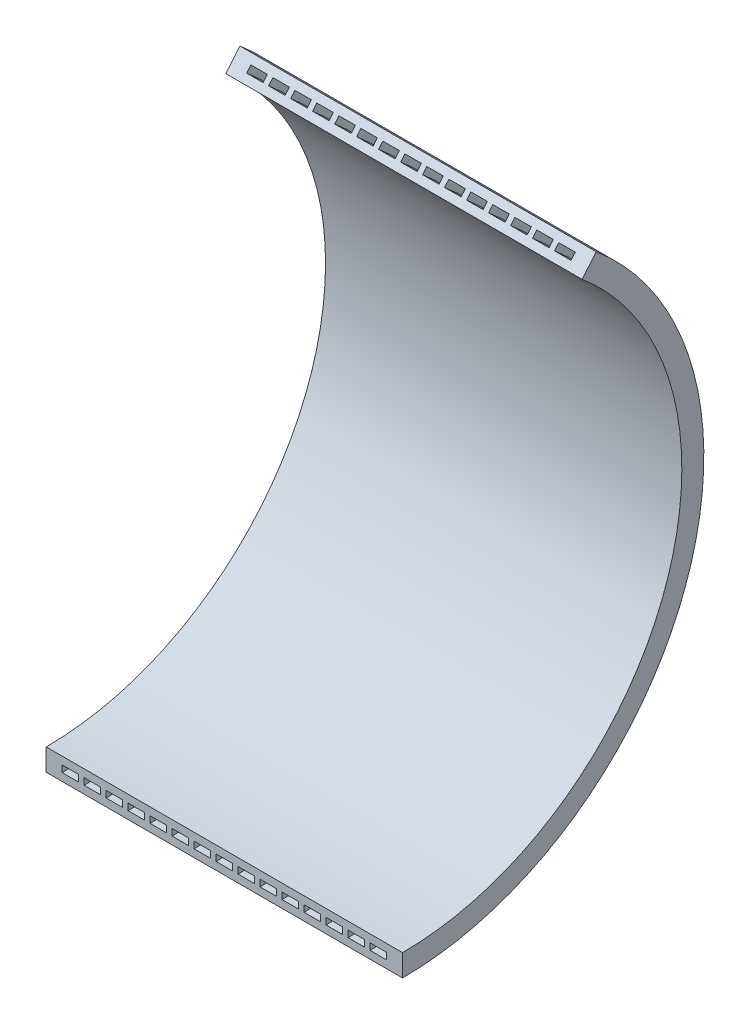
ISO-10303-21;
HEADER;
FILE_DESCRIPTION(('STEP AP214'),'2;1');
FILE_NAME('part.step','',(''),(''),'','','');
FILE_SCHEMA(('AUTOMOTIVE_DESIGN { 1 0 10303 214 1 1 1 1 }'));
ENDSEC;
DATA;
#1=APPLICATION_CONTEXT('core data for automotive mechanical design processes');
#2=APPLICATION_PROTOCOL_DEFINITION('international standard','automotive_design',2000,#1);
#3=PRODUCT_CONTEXT('',#1,'mechanical');
#4=PRODUCT('Part','Part','',(#3));
#5=PRODUCT_RELATED_PRODUCT_CATEGORY('part','',(#4));
#6=PRODUCT_DEFINITION_FORMATION('','',#4);
#7=PRODUCT_DEFINITION_CONTEXT('part definition',#1,'design');
#8=PRODUCT_DEFINITION('design','',#6,#7);
#9=PRODUCT_DEFINITION_SHAPE('','',#8);
#10=(LENGTH_UNIT() NAMED_UNIT(*) SI_UNIT(.MILLI.,.METRE.));
#11=(NAMED_UNIT(*) PLANE_ANGLE_UNIT() SI_UNIT($,.RADIAN.));
#12=(NAMED_UNIT(*) SI_UNIT($,.STERADIAN.) SOLID_ANGLE_UNIT());
#13=UNCERTAINTY_MEASURE_WITH_UNIT(LENGTH_MEASURE(1.E-05),#10,'distance_accuracy_value','');
#14=(GEOMETRIC_REPRESENTATION_CONTEXT(3) GLOBAL_UNCERTAINTY_ASSIGNED_CONTEXT((#13)) GLOBAL_UNIT_ASSIGNED_CONTEXT((#10,
#11,#12)) REPRESENTATION_CONTEXT('',''));
#15=CARTESIAN_POINT('',(0.,0.,0.));
#16=DIRECTION('',(0.,0.,1.));
#17=DIRECTION('',(1.,0.,0.));
#18=AXIS2_PLACEMENT_3D('',#15,#16,#17);
#19=CARTESIAN_POINT('',(-4.74875,87.4425,0.));
#20=DIRECTION('',(-1.,0.,0.));
#21=DIRECTION('',(0.,0.,1.));
#22=AXIS2_PLACEMENT_3D('',#19,#20,#21);
#23=CYLINDRICAL_SURFACE('',#22,85.4775);
#24=CARTESIAN_POINT('',(96.6125,87.4425,0.));
#25=DIRECTION('',(-1.,0.,0.));
#26=DIRECTION('',(0.,0.,1.));
#27=AXIS2_PLACEMENT_3D('',#24,#25,#26);
#28=CIRCLE('',#27,85.4775);
#29=CARTESIAN_POINT('',(96.6125,152.922063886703,-54.9438779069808));
#30=VERTEX_POINT('',#29);
#31=CARTESIAN_POINT('',(96.6125,1.965,0.));
#32=VERTEX_POINT('',#31);
#33=EDGE_CURVE('E11',#30,#32,#28,.T.);
#34=ORIENTED_EDGE('',*,*,#33,.T.);
#35=DIRECTION('',(1.,0.,0.));
#36=VECTOR('',#35,1.);
#37=CARTESIAN_POINT('',(0.,1.965,0.));
#38=LINE('',#37,#36);
#39=CARTESIAN_POINT('',(91.7,1.965,0.));
#40=VERTEX_POINT('',#39);
#41=EDGE_CURVE('E636',#40,#32,#38,.T.);
#42=ORIENTED_EDGE('',*,*,#41,.F.);
#43=CARTESIAN_POINT('',(91.7,87.4425,0.));
#44=DIRECTION('',(-1.,0.,0.));
#45=DIRECTION('',(0.,0.,1.));
#46=AXIS2_PLACEMENT_3D('',#43,#44,#45);
#47=CIRCLE('',#46,85.4775);
#48=CARTESIAN_POINT('',(91.7,152.922063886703,-54.9438779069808));
#49=VERTEX_POINT('',#48);
#50=EDGE_CURVE('E51',#49,#40,#47,.T.);
#51=ORIENTED_EDGE('',*,*,#50,.F.);
#52=DIRECTION('',(1.,0.,0.));
#53=VECTOR('',#52,1.);
#54=CARTESIAN_POINT('',(0.,152.922063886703,-54.9438779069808));
#55=LINE('',#54,#53);
#56=EDGE_CURVE('E825',#49,#30,#55,.T.);
#57=ORIENTED_EDGE('',*,*,#56,.T.);
#58=EDGE_LOOP('',(#34,#42,#51,#57));
#59=FACE_BOUND('',#58,.T.);
#60=ADVANCED_FACE('F36',(#59),#23,.T.);
#61=CARTESIAN_POINT('',(96.6125,154.427341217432,-56.2069555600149));
#62=DIRECTION('',(1.,0.,0.));
#63=DIRECTION('',(0.,0.,-1.));
#64=AXIS2_PLACEMENT_3D('',#61,#62,#63);
#65=PLANE('',#64);
#66=CARTESIAN_POINT('',(96.6125,87.4425,0.));
#67=DIRECTION('',(-1.,0.,0.));
#68=DIRECTION('',(0.,0.,1.));
#69=AXIS2_PLACEMENT_3D('',#66,#67,#68);
#70=CIRCLE('',#69,87.4425);
#71=CARTESIAN_POINT('',(96.6125,154.427341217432,-56.2069555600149));
#72=VERTEX_POINT('',#71);
#73=CARTESIAN_POINT('',(96.6125,0.,0.));
#74=VERTEX_POINT('',#73);
#75=EDGE_CURVE('E44',#72,#74,#70,.T.);
#76=ORIENTED_EDGE('',*,*,#75,.T.);
#77=DIRECTION('',(0.,1.,0.));
#78=VECTOR('',#77,1.);
#79=CARTESIAN_POINT('',(96.6125,0.,0.));
#80=LINE('',#79,#78);
#81=EDGE_CURVE('E639',#74,#32,#80,.T.);
#82=ORIENTED_EDGE('',*,*,#81,.T.);
#83=ORIENTED_EDGE('',*,*,#33,.F.);
#84=DIRECTION('',(0.,-0.766044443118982,0.642787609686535));
#85=VECTOR('',#84,1.);
#86=CARTESIAN_POINT('',(96.6125,154.427341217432,-56.2069555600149));
#87=LINE('',#86,#85);
#88=EDGE_CURVE('E827',#72,#30,#87,.T.);
#89=ORIENTED_EDGE('',*,*,#88,.F.);
#90=EDGE_LOOP('',(#76,#82,#83,#89));
#91=FACE_BOUND('',#90,.T.);
#92=ADVANCED_FACE('F38',(#91),#65,.F.);
#93=CARTESIAN_POINT('',(-4.74875,87.4425,0.));
#94=DIRECTION('',(-1.,0.,0.));
#95=DIRECTION('',(0.,0.,1.));
#96=AXIS2_PLACEMENT_3D('',#93,#94,#95);
#97=CYLINDRICAL_SURFACE('',#96,87.4425);
#98=CARTESIAN_POINT('',(91.7,87.4425,0.));
#99=DIRECTION('',(-1.,0.,0.));
#100=DIRECTION('',(0.,0.,1.));
#101=AXIS2_PLACEMENT_3D('',#98,#99,#100);
#102=CIRCLE('',#101,87.4425);
#103=CARTESIAN_POINT('',(91.7,154.427341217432,-56.2069555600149));
#104=VERTEX_POINT('',#103);
#105=CARTESIAN_POINT('',(91.7,0.,0.));
#106=VERTEX_POINT('',#105);
#107=EDGE_CURVE('E59',#104,#106,#102,.T.);
#108=ORIENTED_EDGE('',*,*,#107,.T.);
#109=DIRECTION('',(1.,0.,0.));
#110=VECTOR('',#109,1.);
#111=CARTESIAN_POINT('',(0.,0.,0.));
#112=LINE('',#111,#110);
#113=EDGE_CURVE('E642',#106,#74,#112,.T.);
#114=ORIENTED_EDGE('',*,*,#113,.T.);
#115=ORIENTED_EDGE('',*,*,#75,.F.);
#116=DIRECTION('',(1.,0.,0.));
#117=VECTOR('',#116,1.);
#118=CARTESIAN_POINT('',(0.,154.427341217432,-56.2069555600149));
#119=LINE('',#118,#117);
#120=EDGE_CURVE('E830',#104,#72,#119,.T.);
#121=ORIENTED_EDGE('',*,*,#120,.F.);
#122=EDGE_LOOP('',(#108,#114,#115,#121));
#123=FACE_BOUND('',#122,.T.);
#124=ADVANCED_FACE('F958',(#123),#97,.F.);
#125=CARTESIAN_POINT('',(-4.74875,87.4425,0.));
#126=DIRECTION('',(-1.,0.,0.));
#127=DIRECTION('',(0.,0.,1.));
#128=AXIS2_PLACEMENT_3D('',#125,#126,#127);
#129=CYLINDRICAL_SURFACE('',#128,87.4425);
#130=CARTESIAN_POINT('',(85.15,87.4425,0.));
#131=DIRECTION('',(-1.,0.,0.));
#132=DIRECTION('',(0.,0.,1.));
#133=AXIS2_PLACEMENT_3D('',#130,#131,#132);
#134=CIRCLE('',#133,87.4425);
#135=CARTESIAN_POINT('',(85.15,154.427341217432,-56.2069555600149));
#136=VERTEX_POINT('',#135);
#137=CARTESIAN_POINT('',(85.15,0.,0.));
#138=VERTEX_POINT('',#137);
#139=EDGE_CURVE('E949',#136,#138,#134,.T.);
#140=ORIENTED_EDGE('',*,*,#139,.T.);
#141=DIRECTION('',(1.,0.,0.));
#142=VECTOR('',#141,1.);
#143=CARTESIAN_POINT('',(0.,0.,0.));
#144=LINE('',#143,#142);
#145=CARTESIAN_POINT('',(90.0625,0.,0.));
#146=VERTEX_POINT('',#145);
#147=EDGE_CURVE('E624',#138,#146,#144,.T.);
#148=ORIENTED_EDGE('',*,*,#147,.T.);
#149=CARTESIAN_POINT('',(90.0625,87.4425,0.));
#150=DIRECTION('',(-1.,0.,0.));
#151=DIRECTION('',(0.,0.,1.));
#152=AXIS2_PLACEMENT_3D('',#149,#150,#151);
#153=CIRCLE('',#152,87.4425);
#154=CARTESIAN_POINT('',(90.0625,154.427341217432,-56.2069555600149));
#155=VERTEX_POINT('',#154);
#156=EDGE_CURVE('E943',#155,#146,#153,.T.);
#157=ORIENTED_EDGE('',*,*,#156,.F.);
#158=DIRECTION('',(1.,0.,0.));
#159=VECTOR('',#158,1.);
#160=CARTESIAN_POINT('',(0.,154.427341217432,-56.2069555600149));
#161=LINE('',#160,#159);
#162=EDGE_CURVE('E813',#136,#155,#161,.T.);
#163=ORIENTED_EDGE('',*,*,#162,.F.);
#164=EDGE_LOOP('',(#140,#148,#157,#163));
#165=FACE_BOUND('',#164,.T.);
#166=ADVANCED_FACE('F975',(#165),#129,.F.);
#167=CARTESIAN_POINT('',(85.15,154.427341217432,-56.2069555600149));
#168=DIRECTION('',(1.,0.,0.));
#169=DIRECTION('',(0.,0.,-1.));
#170=AXIS2_PLACEMENT_3D('',#167,#168,#169);
#171=PLANE('',#170);
#172=CARTESIAN_POINT('',(85.15,87.4425,0.));
#173=DIRECTION('',(-1.,0.,0.));
#174=DIRECTION('',(0.,0.,1.));
#175=AXIS2_PLACEMENT_3D('',#172,#173,#174);
#176=CIRCLE('',#175,85.4775);
#177=CARTESIAN_POINT('',(85.15,152.922063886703,-54.9438779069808));
#178=VERTEX_POINT('',#177);
#179=CARTESIAN_POINT('',(85.15,1.965,0.));
#180=VERTEX_POINT('',#179);
#181=EDGE_CURVE('E947',#178,#180,#176,.T.);
#182=ORIENTED_EDGE('',*,*,#181,.T.);
#183=DIRECTION('',(0.,1.,0.));
#184=VECTOR('',#183,1.);
#185=CARTESIAN_POINT('',(85.15,0.,0.));
#186=LINE('',#185,#184);
#187=EDGE_CURVE('E627',#138,#180,#186,.T.);
#188=ORIENTED_EDGE('',*,*,#187,.F.);
#189=ORIENTED_EDGE('',*,*,#139,.F.);
#190=DIRECTION('',(0.,-0.766044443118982,0.642787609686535));
#191=VECTOR('',#190,1.);
#192=CARTESIAN_POINT('',(85.15,154.427341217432,-56.2069555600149));
#193=LINE('',#192,#191);
#194=EDGE_CURVE('E816',#136,#178,#193,.T.);
#195=ORIENTED_EDGE('',*,*,#194,.T.);
#196=EDGE_LOOP('',(#182,#188,#189,#195));
#197=FACE_BOUND('',#196,.T.);
#198=ADVANCED_FACE('F970',(#197),#171,.T.);
#199=CARTESIAN_POINT('',(-4.74875,87.4425,0.));
#200=DIRECTION('',(-1.,0.,0.));
#201=DIRECTION('',(0.,0.,1.));
#202=AXIS2_PLACEMENT_3D('',#199,#200,#201);
#203=CYLINDRICAL_SURFACE('',#202,85.4775);
#204=CARTESIAN_POINT('',(90.0625,87.4425,0.));
#205=DIRECTION('',(-1.,0.,0.));
#206=DIRECTION('',(0.,0.,1.));
#207=AXIS2_PLACEMENT_3D('',#204,#205,#206);
#208=CIRCLE('',#207,85.4775);
#209=CARTESIAN_POINT('',(90.0625,152.922063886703,-54.9438779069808));
#210=VERTEX_POINT('',#209);
#211=CARTESIAN_POINT('',(90.0625,1.965,0.));
#212=VERTEX_POINT('',#211);
#213=EDGE_CURVE('E945',#210,#212,#208,.T.);
#214=ORIENTED_EDGE('',*,*,#213,.T.);
#215=DIRECTION('',(1.,0.,0.));
#216=VECTOR('',#215,1.);
#217=CARTESIAN_POINT('',(0.,1.965,0.));
#218=LINE('',#217,#216);
#219=EDGE_CURVE('E630',#180,#212,#218,.T.);
#220=ORIENTED_EDGE('',*,*,#219,.F.);
#221=ORIENTED_EDGE('',*,*,#181,.F.);
#222=DIRECTION('',(1.,0.,0.));
#223=VECTOR('',#222,1.);
#224=CARTESIAN_POINT('',(0.,152.922063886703,-54.9438779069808));
#225=LINE('',#224,#223);
#226=EDGE_CURVE('E819',#178,#210,#225,.T.);
#227=ORIENTED_EDGE('',*,*,#226,.T.);
#228=EDGE_LOOP('',(#214,#220,#221,#227));
#229=FACE_BOUND('',#228,.T.);
#230=ADVANCED_FACE('F984',(#229),#203,.T.);
#231=CARTESIAN_POINT('',(-4.74875,87.4425,0.));
#232=DIRECTION('',(-1.,0.,0.));
#233=DIRECTION('',(0.,0.,1.));
#234=AXIS2_PLACEMENT_3D('',#231,#232,#233);
#235=CYLINDRICAL_SURFACE('',#234,87.4425);
#236=CARTESIAN_POINT('',(78.6,87.4425,0.));
#237=DIRECTION('',(-1.,0.,0.));
#238=DIRECTION('',(0.,0.,1.));
#239=AXIS2_PLACEMENT_3D('',#236,#237,#238);
#240=CIRCLE('',#239,87.4425);
#241=CARTESIAN_POINT('',(78.6,154.427341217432,-56.2069555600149));
#242=VERTEX_POINT('',#241);
#243=CARTESIAN_POINT('',(78.6,0.,0.));
#244=VERTEX_POINT('',#243);
#245=EDGE_CURVE('E941',#242,#244,#240,.T.);
#246=ORIENTED_EDGE('',*,*,#245,.T.);
#247=DIRECTION('',(1.,0.,0.));
#248=VECTOR('',#247,1.);
#249=CARTESIAN_POINT('',(0.,0.,0.));
#250=LINE('',#249,#248);
#251=CARTESIAN_POINT('',(83.5125,0.,0.));
#252=VERTEX_POINT('',#251);
#253=EDGE_CURVE('E612',#244,#252,#250,.T.);
#254=ORIENTED_EDGE('',*,*,#253,.T.);
#255=CARTESIAN_POINT('',(83.5125,87.4425,0.));
#256=DIRECTION('',(-1.,0.,0.));
#257=DIRECTION('',(0.,0.,1.));
#258=AXIS2_PLACEMENT_3D('',#255,#256,#257);
#259=CIRCLE('',#258,87.4425);
#260=CARTESIAN_POINT('',(83.5125,154.427341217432,-56.2069555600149));
#261=VERTEX_POINT('',#260);
#262=EDGE_CURVE('E935',#261,#252,#259,.T.);
#263=ORIENTED_EDGE('',*,*,#262,.F.);
#264=DIRECTION('',(1.,0.,0.));
#265=VECTOR('',#264,1.);
#266=CARTESIAN_POINT('',(0.,154.427341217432,-56.2069555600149));
#267=LINE('',#266,#265);
#268=EDGE_CURVE('E801',#242,#261,#267,.T.);
#269=ORIENTED_EDGE('',*,*,#268,.F.);
#270=EDGE_LOOP('',(#246,#254,#263,#269));
#271=FACE_BOUND('',#270,.T.);
#272=ADVANCED_FACE('F996',(#271),#235,.F.);
#273=CARTESIAN_POINT('',(78.6,154.427341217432,-56.2069555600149));
#274=DIRECTION('',(1.,0.,0.));
#275=DIRECTION('',(0.,0.,-1.));
#276=AXIS2_PLACEMENT_3D('',#273,#274,#275);
#277=PLANE('',#276);
#278=CARTESIAN_POINT('',(78.6,87.4425,0.));
#279=DIRECTION('',(-1.,0.,0.));
#280=DIRECTION('',(0.,0.,1.));
#281=AXIS2_PLACEMENT_3D('',#278,#279,#280);
#282=CIRCLE('',#281,85.4775);
#283=CARTESIAN_POINT('',(78.6,152.922063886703,-54.9438779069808));
#284=VERTEX_POINT('',#283);
#285=CARTESIAN_POINT('',(78.6,1.965,0.));
#286=VERTEX_POINT('',#285);
#287=EDGE_CURVE('E939',#284,#286,#282,.T.);
#288=ORIENTED_EDGE('',*,*,#287,.T.);
#289=DIRECTION('',(0.,1.,0.));
#290=VECTOR('',#289,1.);
#291=CARTESIAN_POINT('',(78.6,0.,0.));
#292=LINE('',#291,#290);
#293=EDGE_CURVE('E615',#244,#286,#292,.T.);
#294=ORIENTED_EDGE('',*,*,#293,.F.);
#295=ORIENTED_EDGE('',*,*,#245,.F.);
#296=DIRECTION('',(0.,-0.766044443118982,0.642787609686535));
#297=VECTOR('',#296,1.);
#298=CARTESIAN_POINT('',(78.6,154.427341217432,-56.2069555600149));
#299=LINE('',#298,#297);
#300=EDGE_CURVE('E804',#242,#284,#299,.T.);
#301=ORIENTED_EDGE('',*,*,#300,.T.);
#302=EDGE_LOOP('',(#288,#294,#295,#301));
#303=FACE_BOUND('',#302,.T.);
#304=ADVANCED_FACE('F988',(#303),#277,.T.);
#305=CARTESIAN_POINT('',(-4.74875,87.4425,0.));
#306=DIRECTION('',(-1.,0.,0.));
#307=DIRECTION('',(0.,0.,1.));
#308=AXIS2_PLACEMENT_3D('',#305,#306,#307);
#309=CYLINDRICAL_SURFACE('',#308,85.4775);
#310=CARTESIAN_POINT('',(83.5125,87.4425,0.));
#311=DIRECTION('',(-1.,0.,0.));
#312=DIRECTION('',(0.,0.,1.));
#313=AXIS2_PLACEMENT_3D('',#310,#311,#312);
#314=CIRCLE('',#313,85.4775);
#315=CARTESIAN_POINT('',(83.5125,152.922063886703,-54.9438779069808));
#316=VERTEX_POINT('',#315);
#317=CARTESIAN_POINT('',(83.5125,1.965,0.));
#318=VERTEX_POINT('',#317);
#319=EDGE_CURVE('E937',#316,#318,#314,.T.);
#320=ORIENTED_EDGE('',*,*,#319,.T.);
#321=DIRECTION('',(1.,0.,0.));
#322=VECTOR('',#321,1.);
#323=CARTESIAN_POINT('',(0.,1.965,0.));
#324=LINE('',#323,#322);
#325=EDGE_CURVE('E618',#286,#318,#324,.T.);
#326=ORIENTED_EDGE('',*,*,#325,.F.);
#327=ORIENTED_EDGE('',*,*,#287,.F.);
#328=DIRECTION('',(1.,0.,0.));
#329=VECTOR('',#328,1.);
#330=CARTESIAN_POINT('',(0.,152.922063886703,-54.9438779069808));
#331=LINE('',#330,#329);
#332=EDGE_CURVE('E807',#284,#316,#331,.T.);
#333=ORIENTED_EDGE('',*,*,#332,.T.);
#334=EDGE_LOOP('',(#320,#326,#327,#333));
#335=FACE_BOUND('',#334,.T.);
#336=ADVANCED_FACE('F1214',(#335),#309,.T.);
#337=CARTESIAN_POINT('',(-4.74875,87.4425,0.));
#338=DIRECTION('',(-1.,0.,0.));
#339=DIRECTION('',(0.,0.,1.));
#340=AXIS2_PLACEMENT_3D('',#337,#338,#339);
#341=CYLINDRICAL_SURFACE('',#340,87.4425);
#342=CARTESIAN_POINT('',(72.05,87.4425,0.));
#343=DIRECTION('',(-1.,0.,0.));
#344=DIRECTION('',(0.,0.,1.));
#345=AXIS2_PLACEMENT_3D('',#342,#343,#344);
#346=CIRCLE('',#345,87.4425);
#347=CARTESIAN_POINT('',(72.05,154.427341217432,-56.2069555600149));
#348=VERTEX_POINT('',#347);
#349=CARTESIAN_POINT('',(72.05,0.,0.));
#350=VERTEX_POINT('',#349);
#351=EDGE_CURVE('E933',#348,#350,#346,.T.);
#352=ORIENTED_EDGE('',*,*,#351,.T.);
#353=DIRECTION('',(1.,0.,0.));
#354=VECTOR('',#353,1.);
#355=CARTESIAN_POINT('',(0.,0.,0.));
#356=LINE('',#355,#354);
#357=CARTESIAN_POINT('',(76.9625,0.,0.));
#358=VERTEX_POINT('',#357);
#359=EDGE_CURVE('E600',#350,#358,#356,.T.);
#360=ORIENTED_EDGE('',*,*,#359,.T.);
#361=CARTESIAN_POINT('',(76.9625,87.4425,0.));
#362=DIRECTION('',(-1.,0.,0.));
#363=DIRECTION('',(0.,0.,1.));
#364=AXIS2_PLACEMENT_3D('',#361,#362,#363);
#365=CIRCLE('',#364,87.4425);
#366=CARTESIAN_POINT('',(76.9625,154.427341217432,-56.2069555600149));
#367=VERTEX_POINT('',#366);
#368=EDGE_CURVE('E927',#367,#358,#365,.T.);
#369=ORIENTED_EDGE('',*,*,#368,.F.);
#370=DIRECTION('',(1.,0.,0.));
#371=VECTOR('',#370,1.);
#372=CARTESIAN_POINT('',(0.,154.427341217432,-56.2069555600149));
#373=LINE('',#372,#371);
#374=EDGE_CURVE('E789',#348,#367,#373,.T.);
#375=ORIENTED_EDGE('',*,*,#374,.F.);
#376=EDGE_LOOP('',(#352,#360,#369,#375));
#377=FACE_BOUND('',#376,.T.);
#378=ADVANCED_FACE('F1210',(#377),#341,.F.);
#379=CARTESIAN_POINT('',(72.05,154.427341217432,-56.2069555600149));
#380=DIRECTION('',(1.,0.,0.));
#381=DIRECTION('',(0.,0.,-1.));
#382=AXIS2_PLACEMENT_3D('',#379,#380,#381);
#383=PLANE('',#382);
#384=CARTESIAN_POINT('',(72.05,87.4425,0.));
#385=DIRECTION('',(-1.,0.,0.));
#386=DIRECTION('',(0.,0.,1.));
#387=AXIS2_PLACEMENT_3D('',#384,#385,#386);
#388=CIRCLE('',#387,85.4775);
#389=CARTESIAN_POINT('',(72.05,152.922063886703,-54.9438779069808));
#390=VERTEX_POINT('',#389);
#391=CARTESIAN_POINT('',(72.05,1.965,0.));
#392=VERTEX_POINT('',#391);
#393=EDGE_CURVE('E931',#390,#392,#388,.T.);
#394=ORIENTED_EDGE('',*,*,#393,.T.);
#395=DIRECTION('',(0.,1.,0.));
#396=VECTOR('',#395,1.);
#397=CARTESIAN_POINT('',(72.05,0.,0.));
#398=LINE('',#397,#396);
#399=EDGE_CURVE('E603',#350,#392,#398,.T.);
#400=ORIENTED_EDGE('',*,*,#399,.F.);
#401=ORIENTED_EDGE('',*,*,#351,.F.);
#402=DIRECTION('',(0.,-0.766044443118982,0.642787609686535));
#403=VECTOR('',#402,1.);
#404=CARTESIAN_POINT('',(72.05,154.427341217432,-56.2069555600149));
#405=LINE('',#404,#403);
#406=EDGE_CURVE('E792',#348,#390,#405,.T.);
#407=ORIENTED_EDGE('',*,*,#406,.T.);
#408=EDGE_LOOP('',(#394,#400,#401,#407));
#409=FACE_BOUND('',#408,.T.);
#410=ADVANCED_FACE('F1213',(#409),#383,.T.);
#411=CARTESIAN_POINT('',(-4.74875,87.4425,0.));
#412=DIRECTION('',(-1.,0.,0.));
#413=DIRECTION('',(0.,0.,1.));
#414=AXIS2_PLACEMENT_3D('',#411,#412,#413);
#415=CYLINDRICAL_SURFACE('',#414,85.4775);
#416=CARTESIAN_POINT('',(76.9625,87.4425,0.));
#417=DIRECTION('',(-1.,0.,0.));
#418=DIRECTION('',(0.,0.,1.));
#419=AXIS2_PLACEMENT_3D('',#416,#417,#418);
#420=CIRCLE('',#419,85.4775);
#421=CARTESIAN_POINT('',(76.9625,152.922063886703,-54.9438779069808));
#422=VERTEX_POINT('',#421);
#423=CARTESIAN_POINT('',(76.9625,1.965,0.));
#424=VERTEX_POINT('',#423);
#425=EDGE_CURVE('E929',#422,#424,#420,.T.);
#426=ORIENTED_EDGE('',*,*,#425,.T.);
#427=DIRECTION('',(1.,0.,0.));
#428=VECTOR('',#427,1.);
#429=CARTESIAN_POINT('',(0.,1.965,0.));
#430=LINE('',#429,#428);
#431=EDGE_CURVE('E606',#392,#424,#430,.T.);
#432=ORIENTED_EDGE('',*,*,#431,.F.);
#433=ORIENTED_EDGE('',*,*,#393,.F.);
#434=DIRECTION('',(1.,0.,0.));
#435=VECTOR('',#434,1.);
#436=CARTESIAN_POINT('',(0.,152.922063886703,-54.9438779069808));
#437=LINE('',#436,#435);
#438=EDGE_CURVE('E795',#390,#422,#437,.T.);
#439=ORIENTED_EDGE('',*,*,#438,.T.);
#440=EDGE_LOOP('',(#426,#432,#433,#439));
#441=FACE_BOUND('',#440,.T.);
#442=ADVANCED_FACE('F1198',(#441),#415,.T.);
#443=CARTESIAN_POINT('',(-4.74875,87.4425,0.));
#444=DIRECTION('',(-1.,0.,0.));
#445=DIRECTION('',(0.,0.,1.));
#446=AXIS2_PLACEMENT_3D('',#443,#444,#445);
#447=CYLINDRICAL_SURFACE('',#446,87.4425);
#448=CARTESIAN_POINT('',(65.5,87.4425,0.));
#449=DIRECTION('',(-1.,0.,0.));
#450=DIRECTION('',(0.,0.,1.));
#451=AXIS2_PLACEMENT_3D('',#448,#449,#450);
#452=CIRCLE('',#451,87.4425);
#453=CARTESIAN_POINT('',(65.5,154.427341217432,-56.2069555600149));
#454=VERTEX_POINT('',#453);
#455=CARTESIAN_POINT('',(65.5,0.,0.));
#456=VERTEX_POINT('',#455);
#457=EDGE_CURVE('E925',#454,#456,#452,.T.);
#458=ORIENTED_EDGE('',*,*,#457,.T.);
#459=DIRECTION('',(1.,0.,0.));
#460=VECTOR('',#459,1.);
#461=CARTESIAN_POINT('',(0.,0.,0.));
#462=LINE('',#461,#460);
#463=CARTESIAN_POINT('',(70.4125,0.,0.));
#464=VERTEX_POINT('',#463);
#465=EDGE_CURVE('E588',#456,#464,#462,.T.);
#466=ORIENTED_EDGE('',*,*,#465,.T.);
#467=CARTESIAN_POINT('',(70.4125,87.4425,0.));
#468=DIRECTION('',(-1.,0.,0.));
#469=DIRECTION('',(0.,0.,1.));
#470=AXIS2_PLACEMENT_3D('',#467,#468,#469);
#471=CIRCLE('',#470,87.4425);
#472=CARTESIAN_POINT('',(70.4125,154.427341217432,-56.2069555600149));
#473=VERTEX_POINT('',#472);
#474=EDGE_CURVE('E919',#473,#464,#471,.T.);
#475=ORIENTED_EDGE('',*,*,#474,.F.);
#476=DIRECTION('',(1.,0.,0.));
#477=VECTOR('',#476,1.);
#478=CARTESIAN_POINT('',(0.,154.427341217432,-56.2069555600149));
#479=LINE('',#478,#477);
#480=EDGE_CURVE('E777',#454,#473,#479,.T.);
#481=ORIENTED_EDGE('',*,*,#480,.F.);
#482=EDGE_LOOP('',(#458,#466,#475,#481));
#483=FACE_BOUND('',#482,.T.);
#484=ADVANCED_FACE('F1194',(#483),#447,.F.);
#485=CARTESIAN_POINT('',(65.5,154.427341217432,-56.2069555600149));
#486=DIRECTION('',(1.,0.,0.));
#487=DIRECTION('',(0.,0.,-1.));
#488=AXIS2_PLACEMENT_3D('',#485,#486,#487);
#489=PLANE('',#488);
#490=CARTESIAN_POINT('',(65.5,87.4425,0.));
#491=DIRECTION('',(-1.,0.,0.));
#492=DIRECTION('',(0.,0.,1.));
#493=AXIS2_PLACEMENT_3D('',#490,#491,#492);
#494=CIRCLE('',#493,85.4775);
#495=CARTESIAN_POINT('',(65.5,152.922063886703,-54.9438779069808));
#496=VERTEX_POINT('',#495);
#497=CARTESIAN_POINT('',(65.5,1.965,0.));
#498=VERTEX_POINT('',#497);
#499=EDGE_CURVE('E923',#496,#498,#494,.T.);
#500=ORIENTED_EDGE('',*,*,#499,.T.);
#501=DIRECTION('',(0.,1.,0.));
#502=VECTOR('',#501,1.);
#503=CARTESIAN_POINT('',(65.5,0.,0.));
#504=LINE('',#503,#502);
#505=EDGE_CURVE('E591',#456,#498,#504,.T.);
#506=ORIENTED_EDGE('',*,*,#505,.F.);
#507=ORIENTED_EDGE('',*,*,#457,.F.);
#508=DIRECTION('',(0.,-0.766044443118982,0.642787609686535));
#509=VECTOR('',#508,1.);
#510=CARTESIAN_POINT('',(65.5,154.427341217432,-56.2069555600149));
#511=LINE('',#510,#509);
#512=EDGE_CURVE('E780',#454,#496,#511,.T.);
#513=ORIENTED_EDGE('',*,*,#512,.T.);
#514=EDGE_LOOP('',(#500,#506,#507,#513));
#515=FACE_BOUND('',#514,.T.);
#516=ADVANCED_FACE('F1197',(#515),#489,.T.);
#517=CARTESIAN_POINT('',(-4.74875,87.4425,0.));
#518=DIRECTION('',(-1.,0.,0.));
#519=DIRECTION('',(0.,0.,1.));
#520=AXIS2_PLACEMENT_3D('',#517,#518,#519);
#521=CYLINDRICAL_SURFACE('',#520,85.4775);
#522=CARTESIAN_POINT('',(70.4125,87.4425,0.));
#523=DIRECTION('',(-1.,0.,0.));
#524=DIRECTION('',(0.,0.,1.));
#525=AXIS2_PLACEMENT_3D('',#522,#523,#524);
#526=CIRCLE('',#525,85.4775);
#527=CARTESIAN_POINT('',(70.4125,152.922063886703,-54.9438779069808));
#528=VERTEX_POINT('',#527);
#529=CARTESIAN_POINT('',(70.4125,1.965,0.));
#530=VERTEX_POINT('',#529);
#531=EDGE_CURVE('E921',#528,#530,#526,.T.);
#532=ORIENTED_EDGE('',*,*,#531,.T.);
#533=DIRECTION('',(1.,0.,0.));
#534=VECTOR('',#533,1.);
#535=CARTESIAN_POINT('',(0.,1.965,0.));
#536=LINE('',#535,#534);
#537=EDGE_CURVE('E594',#498,#530,#536,.T.);
#538=ORIENTED_EDGE('',*,*,#537,.F.);
#539=ORIENTED_EDGE('',*,*,#499,.F.);
#540=DIRECTION('',(1.,0.,0.));
#541=VECTOR('',#540,1.);
#542=CARTESIAN_POINT('',(0.,152.922063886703,-54.9438779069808));
#543=LINE('',#542,#541);
#544=EDGE_CURVE('E783',#496,#528,#543,.T.);
#545=ORIENTED_EDGE('',*,*,#544,.T.);
#546=EDGE_LOOP('',(#532,#538,#539,#545));
#547=FACE_BOUND('',#546,.T.);
#548=ADVANCED_FACE('F1182',(#547),#521,.T.);
#549=CARTESIAN_POINT('',(-4.74875,87.4425,0.));
#550=DIRECTION('',(-1.,0.,0.));
#551=DIRECTION('',(0.,0.,1.));
#552=AXIS2_PLACEMENT_3D('',#549,#550,#551);
#553=CYLINDRICAL_SURFACE('',#552,87.4425);
#554=CARTESIAN_POINT('',(58.95,87.4425,0.));
#555=DIRECTION('',(-1.,0.,0.));
#556=DIRECTION('',(0.,0.,1.));
#557=AXIS2_PLACEMENT_3D('',#554,#555,#556);
#558=CIRCLE('',#557,87.4425);
#559=CARTESIAN_POINT('',(58.95,154.427341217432,-56.2069555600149));
#560=VERTEX_POINT('',#559);
#561=CARTESIAN_POINT('',(58.95,0.,0.));
#562=VERTEX_POINT('',#561);
#563=EDGE_CURVE('E917',#560,#562,#558,.T.);
#564=ORIENTED_EDGE('',*,*,#563,.T.);
#565=DIRECTION('',(1.,0.,0.));
#566=VECTOR('',#565,1.);
#567=CARTESIAN_POINT('',(0.,0.,0.));
#568=LINE('',#567,#566);
#569=CARTESIAN_POINT('',(63.8625,0.,0.));
#570=VERTEX_POINT('',#569);
#571=EDGE_CURVE('E576',#562,#570,#568,.T.);
#572=ORIENTED_EDGE('',*,*,#571,.T.);
#573=CARTESIAN_POINT('',(63.8625,87.4425,0.));
#574=DIRECTION('',(-1.,0.,0.));
#575=DIRECTION('',(0.,0.,1.));
#576=AXIS2_PLACEMENT_3D('',#573,#574,#575);
#577=CIRCLE('',#576,87.4425);
#578=CARTESIAN_POINT('',(63.8625,154.427341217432,-56.2069555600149));
#579=VERTEX_POINT('',#578);
#580=EDGE_CURVE('E911',#579,#570,#577,.T.);
#581=ORIENTED_EDGE('',*,*,#580,.F.);
#582=DIRECTION('',(1.,0.,0.));
#583=VECTOR('',#582,1.);
#584=CARTESIAN_POINT('',(0.,154.427341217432,-56.2069555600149));
#585=LINE('',#584,#583);
#586=EDGE_CURVE('E765',#560,#579,#585,.T.);
#587=ORIENTED_EDGE('',*,*,#586,.F.);
#588=EDGE_LOOP('',(#564,#572,#581,#587));
#589=FACE_BOUND('',#588,.T.);
#590=ADVANCED_FACE('F1178',(#589),#553,.F.);
#591=CARTESIAN_POINT('',(58.95,154.427341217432,-56.2069555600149));
#592=DIRECTION('',(1.,0.,0.));
#593=DIRECTION('',(0.,0.,-1.));
#594=AXIS2_PLACEMENT_3D('',#591,#592,#593);
#595=PLANE('',#594);
#596=CARTESIAN_POINT('',(58.95,87.4425,0.));
#597=DIRECTION('',(-1.,0.,0.));
#598=DIRECTION('',(0.,0.,1.));
#599=AXIS2_PLACEMENT_3D('',#596,#597,#598);
#600=CIRCLE('',#599,85.4775);
#601=CARTESIAN_POINT('',(58.95,152.922063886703,-54.9438779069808));
#602=VERTEX_POINT('',#601);
#603=CARTESIAN_POINT('',(58.95,1.965,0.));
#604=VERTEX_POINT('',#603);
#605=EDGE_CURVE('E915',#602,#604,#600,.T.);
#606=ORIENTED_EDGE('',*,*,#605,.T.);
#607=DIRECTION('',(0.,1.,0.));
#608=VECTOR('',#607,1.);
#609=CARTESIAN_POINT('',(58.95,0.,0.));
#610=LINE('',#609,#608);
#611=EDGE_CURVE('E579',#562,#604,#610,.T.);
#612=ORIENTED_EDGE('',*,*,#611,.F.);
#613=ORIENTED_EDGE('',*,*,#563,.F.);
#614=DIRECTION('',(0.,-0.766044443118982,0.642787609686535));
#615=VECTOR('',#614,1.);
#616=CARTESIAN_POINT('',(58.95,154.427341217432,-56.2069555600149));
#617=LINE('',#616,#615);
#618=EDGE_CURVE('E768',#560,#602,#617,.T.);
#619=ORIENTED_EDGE('',*,*,#618,.T.);
#620=EDGE_LOOP('',(#606,#612,#613,#619));
#621=FACE_BOUND('',#620,.T.);
#622=ADVANCED_FACE('F1181',(#621),#595,.T.);
#623=CARTESIAN_POINT('',(-4.74875,87.4425,0.));
#624=DIRECTION('',(-1.,0.,0.));
#625=DIRECTION('',(0.,0.,1.));
#626=AXIS2_PLACEMENT_3D('',#623,#624,#625);
#627=CYLINDRICAL_SURFACE('',#626,85.4775);
#628=CARTESIAN_POINT('',(63.8625,87.4425,0.));
#629=DIRECTION('',(-1.,0.,0.));
#630=DIRECTION('',(0.,0.,1.));
#631=AXIS2_PLACEMENT_3D('',#628,#629,#630);
#632=CIRCLE('',#631,85.4775);
#633=CARTESIAN_POINT('',(63.8625,152.922063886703,-54.9438779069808));
#634=VERTEX_POINT('',#633);
#635=CARTESIAN_POINT('',(63.8625,1.965,0.));
#636=VERTEX_POINT('',#635);
#637=EDGE_CURVE('E913',#634,#636,#632,.T.);
#638=ORIENTED_EDGE('',*,*,#637,.T.);
#639=DIRECTION('',(1.,0.,0.));
#640=VECTOR('',#639,1.);
#641=CARTESIAN_POINT('',(0.,1.965,0.));
#642=LINE('',#641,#640);
#643=EDGE_CURVE('E582',#604,#636,#642,.T.);
#644=ORIENTED_EDGE('',*,*,#643,.F.);
#645=ORIENTED_EDGE('',*,*,#605,.F.);
#646=DIRECTION('',(1.,0.,0.));
#647=VECTOR('',#646,1.);
#648=CARTESIAN_POINT('',(0.,152.922063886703,-54.9438779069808));
#649=LINE('',#648,#647);
#650=EDGE_CURVE('E771',#602,#634,#649,.T.);
#651=ORIENTED_EDGE('',*,*,#650,.T.);
#652=EDGE_LOOP('',(#638,#644,#645,#651));
#653=FACE_BOUND('',#652,.T.);
#654=ADVANCED_FACE('F1166',(#653),#627,.T.);
#655=CARTESIAN_POINT('',(-4.74875,87.4425,0.));
#656=DIRECTION('',(-1.,0.,0.));
#657=DIRECTION('',(0.,0.,1.));
#658=AXIS2_PLACEMENT_3D('',#655,#656,#657);
#659=CYLINDRICAL_SURFACE('',#658,87.4425);
#660=CARTESIAN_POINT('',(52.4,87.4425,0.));
#661=DIRECTION('',(-1.,0.,0.));
#662=DIRECTION('',(0.,0.,1.));
#663=AXIS2_PLACEMENT_3D('',#660,#661,#662);
#664=CIRCLE('',#663,87.4425);
#665=CARTESIAN_POINT('',(52.4,154.427341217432,-56.2069555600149));
#666=VERTEX_POINT('',#665);
#667=CARTESIAN_POINT('',(52.4,0.,0.));
#668=VERTEX_POINT('',#667);
#669=EDGE_CURVE('E909',#666,#668,#664,.T.);
#670=ORIENTED_EDGE('',*,*,#669,.T.);
#671=DIRECTION('',(1.,0.,0.));
#672=VECTOR('',#671,1.);
#673=CARTESIAN_POINT('',(0.,0.,0.));
#674=LINE('',#673,#672);
#675=CARTESIAN_POINT('',(57.3125,0.,0.));
#676=VERTEX_POINT('',#675);
#677=EDGE_CURVE('E564',#668,#676,#674,.T.);
#678=ORIENTED_EDGE('',*,*,#677,.T.);
#679=CARTESIAN_POINT('',(57.3125,87.4425,0.));
#680=DIRECTION('',(-1.,0.,0.));
#681=DIRECTION('',(0.,0.,1.));
#682=AXIS2_PLACEMENT_3D('',#679,#680,#681);
#683=CIRCLE('',#682,87.4425);
#684=CARTESIAN_POINT('',(57.3125,154.427341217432,-56.2069555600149));
#685=VERTEX_POINT('',#684);
#686=EDGE_CURVE('E903',#685,#676,#683,.T.);
#687=ORIENTED_EDGE('',*,*,#686,.F.);
#688=DIRECTION('',(1.,0.,0.));
#689=VECTOR('',#688,1.);
#690=CARTESIAN_POINT('',(0.,154.427341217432,-56.2069555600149));
#691=LINE('',#690,#689);
#692=EDGE_CURVE('E753',#666,#685,#691,.T.);
#693=ORIENTED_EDGE('',*,*,#692,.F.);
#694=EDGE_LOOP('',(#670,#678,#687,#693));
#695=FACE_BOUND('',#694,.T.);
#696=ADVANCED_FACE('F1162',(#695),#659,.F.);
#697=CARTESIAN_POINT('',(52.4,154.427341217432,-56.2069555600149));
#698=DIRECTION('',(1.,0.,0.));
#699=DIRECTION('',(0.,0.,-1.));
#700=AXIS2_PLACEMENT_3D('',#697,#698,#699);
#701=PLANE('',#700);
#702=CARTESIAN_POINT('',(52.4,87.4425,0.));
#703=DIRECTION('',(-1.,0.,0.));
#704=DIRECTION('',(0.,0.,1.));
#705=AXIS2_PLACEMENT_3D('',#702,#703,#704);
#706=CIRCLE('',#705,85.4775);
#707=CARTESIAN_POINT('',(52.4,152.922063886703,-54.9438779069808));
#708=VERTEX_POINT('',#707);
#709=CARTESIAN_POINT('',(52.4,1.965,0.));
#710=VERTEX_POINT('',#709);
#711=EDGE_CURVE('E907',#708,#710,#706,.T.);
#712=ORIENTED_EDGE('',*,*,#711,.T.);
#713=DIRECTION('',(0.,1.,0.));
#714=VECTOR('',#713,1.);
#715=CARTESIAN_POINT('',(52.4,0.,0.));
#716=LINE('',#715,#714);
#717=EDGE_CURVE('E567',#668,#710,#716,.T.);
#718=ORIENTED_EDGE('',*,*,#717,.F.);
#719=ORIENTED_EDGE('',*,*,#669,.F.);
#720=DIRECTION('',(0.,-0.766044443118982,0.642787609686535));
#721=VECTOR('',#720,1.);
#722=CARTESIAN_POINT('',(52.4,154.427341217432,-56.2069555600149));
#723=LINE('',#722,#721);
#724=EDGE_CURVE('E756',#666,#708,#723,.T.);
#725=ORIENTED_EDGE('',*,*,#724,.T.);
#726=EDGE_LOOP('',(#712,#718,#719,#725));
#727=FACE_BOUND('',#726,.T.);
#728=ADVANCED_FACE('F1165',(#727),#701,.T.);
#729=CARTESIAN_POINT('',(-4.74875,87.4425,0.));
#730=DIRECTION('',(-1.,0.,0.));
#731=DIRECTION('',(0.,0.,1.));
#732=AXIS2_PLACEMENT_3D('',#729,#730,#731);
#733=CYLINDRICAL_SURFACE('',#732,85.4775);
#734=CARTESIAN_POINT('',(57.3125,87.4425,0.));
#735=DIRECTION('',(-1.,0.,0.));
#736=DIRECTION('',(0.,0.,1.));
#737=AXIS2_PLACEMENT_3D('',#734,#735,#736);
#738=CIRCLE('',#737,85.4775);
#739=CARTESIAN_POINT('',(57.3125,152.922063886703,-54.9438779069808));
#740=VERTEX_POINT('',#739);
#741=CARTESIAN_POINT('',(57.3125,1.965,0.));
#742=VERTEX_POINT('',#741);
#743=EDGE_CURVE('E905',#740,#742,#738,.T.);
#744=ORIENTED_EDGE('',*,*,#743,.T.);
#745=DIRECTION('',(1.,0.,0.));
#746=VECTOR('',#745,1.);
#747=CARTESIAN_POINT('',(0.,1.965,0.));
#748=LINE('',#747,#746);
#749=EDGE_CURVE('E570',#710,#742,#748,.T.);
#750=ORIENTED_EDGE('',*,*,#749,.F.);
#751=ORIENTED_EDGE('',*,*,#711,.F.);
#752=DIRECTION('',(1.,0.,0.));
#753=VECTOR('',#752,1.);
#754=CARTESIAN_POINT('',(0.,152.922063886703,-54.9438779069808));
#755=LINE('',#754,#753);
#756=EDGE_CURVE('E759',#708,#740,#755,.T.);
#757=ORIENTED_EDGE('',*,*,#756,.T.);
#758=EDGE_LOOP('',(#744,#750,#751,#757));
#759=FACE_BOUND('',#758,.T.);
#760=ADVANCED_FACE('F1150',(#759),#733,.T.);
#761=CARTESIAN_POINT('',(-4.74875,87.4425,0.));
#762=DIRECTION('',(-1.,0.,0.));
#763=DIRECTION('',(0.,0.,1.));
#764=AXIS2_PLACEMENT_3D('',#761,#762,#763);
#765=CYLINDRICAL_SURFACE('',#764,87.4425);
#766=CARTESIAN_POINT('',(45.85,87.4425,0.));
#767=DIRECTION('',(-1.,0.,0.));
#768=DIRECTION('',(0.,0.,1.));
#769=AXIS2_PLACEMENT_3D('',#766,#767,#768);
#770=CIRCLE('',#769,87.4425);
#771=CARTESIAN_POINT('',(45.85,154.427341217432,-56.2069555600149));
#772=VERTEX_POINT('',#771);
#773=CARTESIAN_POINT('',(45.85,0.,0.));
#774=VERTEX_POINT('',#773);
#775=EDGE_CURVE('E901',#772,#774,#770,.T.);
#776=ORIENTED_EDGE('',*,*,#775,.T.);
#777=DIRECTION('',(1.,0.,0.));
#778=VECTOR('',#777,1.);
#779=CARTESIAN_POINT('',(0.,0.,0.));
#780=LINE('',#779,#778);
#781=CARTESIAN_POINT('',(50.7625,0.,0.));
#782=VERTEX_POINT('',#781);
#783=EDGE_CURVE('E552',#774,#782,#780,.T.);
#784=ORIENTED_EDGE('',*,*,#783,.T.);
#785=CARTESIAN_POINT('',(50.7625,87.4425,0.));
#786=DIRECTION('',(-1.,0.,0.));
#787=DIRECTION('',(0.,0.,1.));
#788=AXIS2_PLACEMENT_3D('',#785,#786,#787);
#789=CIRCLE('',#788,87.4425);
#790=CARTESIAN_POINT('',(50.7625,154.427341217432,-56.2069555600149));
#791=VERTEX_POINT('',#790);
#792=EDGE_CURVE('E895',#791,#782,#789,.T.);
#793=ORIENTED_EDGE('',*,*,#792,.F.);
#794=DIRECTION('',(1.,0.,0.));
#795=VECTOR('',#794,1.);
#796=CARTESIAN_POINT('',(0.,154.427341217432,-56.2069555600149));
#797=LINE('',#796,#795);
#798=EDGE_CURVE('E741',#772,#791,#797,.T.);
#799=ORIENTED_EDGE('',*,*,#798,.F.);
#800=EDGE_LOOP('',(#776,#784,#793,#799));
#801=FACE_BOUND('',#800,.T.);
#802=ADVANCED_FACE('F1146',(#801),#765,.F.);
#803=CARTESIAN_POINT('',(45.85,154.427341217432,-56.2069555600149));
#804=DIRECTION('',(1.,0.,0.));
#805=DIRECTION('',(0.,0.,-1.));
#806=AXIS2_PLACEMENT_3D('',#803,#804,#805);
#807=PLANE('',#806);
#808=CARTESIAN_POINT('',(45.85,87.4425,0.));
#809=DIRECTION('',(-1.,0.,0.));
#810=DIRECTION('',(0.,0.,1.));
#811=AXIS2_PLACEMENT_3D('',#808,#809,#810);
#812=CIRCLE('',#811,85.4775);
#813=CARTESIAN_POINT('',(45.85,152.922063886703,-54.9438779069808));
#814=VERTEX_POINT('',#813);
#815=CARTESIAN_POINT('',(45.85,1.965,0.));
#816=VERTEX_POINT('',#815);
#817=EDGE_CURVE('E899',#814,#816,#812,.T.);
#818=ORIENTED_EDGE('',*,*,#817,.T.);
#819=DIRECTION('',(0.,1.,0.));
#820=VECTOR('',#819,1.);
#821=CARTESIAN_POINT('',(45.85,0.,0.));
#822=LINE('',#821,#820);
#823=EDGE_CURVE('E555',#774,#816,#822,.T.);
#824=ORIENTED_EDGE('',*,*,#823,.F.);
#825=ORIENTED_EDGE('',*,*,#775,.F.);
#826=DIRECTION('',(0.,-0.766044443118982,0.642787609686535));
#827=VECTOR('',#826,1.);
#828=CARTESIAN_POINT('',(45.85,154.427341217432,-56.2069555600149));
#829=LINE('',#828,#827);
#830=EDGE_CURVE('E744',#772,#814,#829,.T.);
#831=ORIENTED_EDGE('',*,*,#830,.T.);
#832=EDGE_LOOP('',(#818,#824,#825,#831));
#833=FACE_BOUND('',#832,.T.);
#834=ADVANCED_FACE('F1149',(#833),#807,.T.);
#835=CARTESIAN_POINT('',(-4.74875,87.4425,0.));
#836=DIRECTION('',(-1.,0.,0.));
#837=DIRECTION('',(0.,0.,1.));
#838=AXIS2_PLACEMENT_3D('',#835,#836,#837);
#839=CYLINDRICAL_SURFACE('',#838,85.4775);
#840=CARTESIAN_POINT('',(50.7625,87.4425,0.));
#841=DIRECTION('',(-1.,0.,0.));
#842=DIRECTION('',(0.,0.,1.));
#843=AXIS2_PLACEMENT_3D('',#840,#841,#842);
#844=CIRCLE('',#843,85.4775);
#845=CARTESIAN_POINT('',(50.7625,152.922063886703,-54.9438779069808));
#846=VERTEX_POINT('',#845);
#847=CARTESIAN_POINT('',(50.7625,1.965,0.));
#848=VERTEX_POINT('',#847);
#849=EDGE_CURVE('E897',#846,#848,#844,.T.);
#850=ORIENTED_EDGE('',*,*,#849,.T.);
#851=DIRECTION('',(1.,0.,0.));
#852=VECTOR('',#851,1.);
#853=CARTESIAN_POINT('',(0.,1.965,0.));
#854=LINE('',#853,#852);
#855=EDGE_CURVE('E558',#816,#848,#854,.T.);
#856=ORIENTED_EDGE('',*,*,#855,.F.);
#857=ORIENTED_EDGE('',*,*,#817,.F.);
#858=DIRECTION('',(1.,0.,0.));
#859=VECTOR('',#858,1.);
#860=CARTESIAN_POINT('',(0.,152.922063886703,-54.9438779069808));
#861=LINE('',#860,#859);
#862=EDGE_CURVE('E747',#814,#846,#861,.T.);
#863=ORIENTED_EDGE('',*,*,#862,.T.);
#864=EDGE_LOOP('',(#850,#856,#857,#863));
#865=FACE_BOUND('',#864,.T.);
#866=ADVANCED_FACE('F1134',(#865),#839,.T.);
#867=CARTESIAN_POINT('',(-4.74875,87.4425,0.));
#868=DIRECTION('',(-1.,0.,0.));
#869=DIRECTION('',(0.,0.,1.));
#870=AXIS2_PLACEMENT_3D('',#867,#868,#869);
#871=CYLINDRICAL_SURFACE('',#870,87.4425);
#872=CARTESIAN_POINT('',(39.3,87.4425,0.));
#873=DIRECTION('',(-1.,0.,0.));
#874=DIRECTION('',(0.,0.,1.));
#875=AXIS2_PLACEMENT_3D('',#872,#873,#874);
#876=CIRCLE('',#875,87.4425);
#877=CARTESIAN_POINT('',(39.3,154.427341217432,-56.2069555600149));
#878=VERTEX_POINT('',#877);
#879=CARTESIAN_POINT('',(39.3,0.,0.));
#880=VERTEX_POINT('',#879);
#881=EDGE_CURVE('E893',#878,#880,#876,.T.);
#882=ORIENTED_EDGE('',*,*,#881,.T.);
#883=DIRECTION('',(1.,0.,0.));
#884=VECTOR('',#883,1.);
#885=CARTESIAN_POINT('',(0.,0.,0.));
#886=LINE('',#885,#884);
#887=CARTESIAN_POINT('',(44.2125,0.,0.));
#888=VERTEX_POINT('',#887);
#889=EDGE_CURVE('E540',#880,#888,#886,.T.);
#890=ORIENTED_EDGE('',*,*,#889,.T.);
#891=CARTESIAN_POINT('',(44.2125,87.4425,0.));
#892=DIRECTION('',(-1.,0.,0.));
#893=DIRECTION('',(0.,0.,1.));
#894=AXIS2_PLACEMENT_3D('',#891,#892,#893);
#895=CIRCLE('',#894,87.4425);
#896=CARTESIAN_POINT('',(44.2125,154.427341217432,-56.2069555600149));
#897=VERTEX_POINT('',#896);
#898=EDGE_CURVE('E887',#897,#888,#895,.T.);
#899=ORIENTED_EDGE('',*,*,#898,.F.);
#900=DIRECTION('',(1.,0.,0.));
#901=VECTOR('',#900,1.);
#902=CARTESIAN_POINT('',(0.,154.427341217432,-56.2069555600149));
#903=LINE('',#902,#901);
#904=EDGE_CURVE('E729',#878,#897,#903,.T.);
#905=ORIENTED_EDGE('',*,*,#904,.F.);
#906=EDGE_LOOP('',(#882,#890,#899,#905));
#907=FACE_BOUND('',#906,.T.);
#908=ADVANCED_FACE('F1130',(#907),#871,.F.);
#909=CARTESIAN_POINT('',(39.3,154.427341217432,-56.2069555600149));
#910=DIRECTION('',(1.,0.,0.));
#911=DIRECTION('',(0.,0.,-1.));
#912=AXIS2_PLACEMENT_3D('',#909,#910,#911);
#913=PLANE('',#912);
#914=CARTESIAN_POINT('',(39.3,87.4425,0.));
#915=DIRECTION('',(-1.,0.,0.));
#916=DIRECTION('',(0.,0.,1.));
#917=AXIS2_PLACEMENT_3D('',#914,#915,#916);
#918=CIRCLE('',#917,85.4775);
#919=CARTESIAN_POINT('',(39.3,152.922063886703,-54.9438779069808));
#920=VERTEX_POINT('',#919);
#921=CARTESIAN_POINT('',(39.3,1.965,0.));
#922=VERTEX_POINT('',#921);
#923=EDGE_CURVE('E891',#920,#922,#918,.T.);
#924=ORIENTED_EDGE('',*,*,#923,.T.);
#925=DIRECTION('',(0.,1.,0.));
#926=VECTOR('',#925,1.);
#927=CARTESIAN_POINT('',(39.3,0.,0.));
#928=LINE('',#927,#926);
#929=EDGE_CURVE('E543',#880,#922,#928,.T.);
#930=ORIENTED_EDGE('',*,*,#929,.F.);
#931=ORIENTED_EDGE('',*,*,#881,.F.);
#932=DIRECTION('',(0.,-0.766044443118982,0.642787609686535));
#933=VECTOR('',#932,1.);
#934=CARTESIAN_POINT('',(39.3,154.427341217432,-56.2069555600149));
#935=LINE('',#934,#933);
#936=EDGE_CURVE('E732',#878,#920,#935,.T.);
#937=ORIENTED_EDGE('',*,*,#936,.T.);
#938=EDGE_LOOP('',(#924,#930,#931,#937));
#939=FACE_BOUND('',#938,.T.);
#940=ADVANCED_FACE('F1133',(#939),#913,.T.);
#941=CARTESIAN_POINT('',(-4.74875,87.4425,0.));
#942=DIRECTION('',(-1.,0.,0.));
#943=DIRECTION('',(0.,0.,1.));
#944=AXIS2_PLACEMENT_3D('',#941,#942,#943);
#945=CYLINDRICAL_SURFACE('',#944,85.4775);
#946=CARTESIAN_POINT('',(44.2125,87.4425,0.));
#947=DIRECTION('',(-1.,0.,0.));
#948=DIRECTION('',(0.,0.,1.));
#949=AXIS2_PLACEMENT_3D('',#946,#947,#948);
#950=CIRCLE('',#949,85.4775);
#951=CARTESIAN_POINT('',(44.2125,152.922063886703,-54.9438779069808));
#952=VERTEX_POINT('',#951);
#953=CARTESIAN_POINT('',(44.2125,1.965,0.));
#954=VERTEX_POINT('',#953);
#955=EDGE_CURVE('E889',#952,#954,#950,.T.);
#956=ORIENTED_EDGE('',*,*,#955,.T.);
#957=DIRECTION('',(1.,0.,0.));
#958=VECTOR('',#957,1.);
#959=CARTESIAN_POINT('',(0.,1.965,0.));
#960=LINE('',#959,#958);
#961=EDGE_CURVE('E546',#922,#954,#960,.T.);
#962=ORIENTED_EDGE('',*,*,#961,.F.);
#963=ORIENTED_EDGE('',*,*,#923,.F.);
#964=DIRECTION('',(1.,0.,0.));
#965=VECTOR('',#964,1.);
#966=CARTESIAN_POINT('',(0.,152.922063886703,-54.9438779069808));
#967=LINE('',#966,#965);
#968=EDGE_CURVE('E735',#920,#952,#967,.T.);
#969=ORIENTED_EDGE('',*,*,#968,.T.);
#970=EDGE_LOOP('',(#956,#962,#963,#969));
#971=FACE_BOUND('',#970,.T.);
#972=ADVANCED_FACE('F1118',(#971),#945,.T.);
#973=CARTESIAN_POINT('',(-4.74875,87.4425,0.));
#974=DIRECTION('',(-1.,0.,0.));
#975=DIRECTION('',(0.,0.,1.));
#976=AXIS2_PLACEMENT_3D('',#973,#974,#975);
#977=CYLINDRICAL_SURFACE('',#976,87.4425);
#978=CARTESIAN_POINT('',(32.75,87.4425,0.));
#979=DIRECTION('',(-1.,0.,0.));
#980=DIRECTION('',(0.,0.,1.));
#981=AXIS2_PLACEMENT_3D('',#978,#979,#980);
#982=CIRCLE('',#981,87.4425);
#983=CARTESIAN_POINT('',(32.75,154.427341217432,-56.2069555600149));
#984=VERTEX_POINT('',#983);
#985=CARTESIAN_POINT('',(32.75,0.,0.));
#986=VERTEX_POINT('',#985);
#987=EDGE_CURVE('E885',#984,#986,#982,.T.);
#988=ORIENTED_EDGE('',*,*,#987,.T.);
#989=DIRECTION('',(1.,0.,0.));
#990=VECTOR('',#989,1.);
#991=CARTESIAN_POINT('',(0.,0.,0.));
#992=LINE('',#991,#990);
#993=CARTESIAN_POINT('',(37.6625,0.,0.));
#994=VERTEX_POINT('',#993);
#995=EDGE_CURVE('E528',#986,#994,#992,.T.);
#996=ORIENTED_EDGE('',*,*,#995,.T.);
#997=CARTESIAN_POINT('',(37.6625,87.4425,0.));
#998=DIRECTION('',(-1.,0.,0.));
#999=DIRECTION('',(0.,0.,1.));
#1000=AXIS2_PLACEMENT_3D('',#997,#998,#999);
#1001=CIRCLE('',#1000,87.4425);
#1002=CARTESIAN_POINT('',(37.6625,154.427341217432,-56.2069555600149));
#1003=VERTEX_POINT('',#1002);
#1004=EDGE_CURVE('E879',#1003,#994,#1001,.T.);
#1005=ORIENTED_EDGE('',*,*,#1004,.F.);
#1006=DIRECTION('',(1.,0.,0.));
#1007=VECTOR('',#1006,1.);
#1008=CARTESIAN_POINT('',(0.,154.427341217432,-56.2069555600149));
#1009=LINE('',#1008,#1007);
#1010=EDGE_CURVE('E717',#984,#1003,#1009,.T.);
#1011=ORIENTED_EDGE('',*,*,#1010,.F.);
#1012=EDGE_LOOP('',(#988,#996,#1005,#1011));
#1013=FACE_BOUND('',#1012,.T.);
#1014=ADVANCED_FACE('F1114',(#1013),#977,.F.);
#1015=CARTESIAN_POINT('',(32.75,154.427341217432,-56.2069555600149));
#1016=DIRECTION('',(1.,0.,0.));
#1017=DIRECTION('',(0.,0.,-1.));
#1018=AXIS2_PLACEMENT_3D('',#1015,#1016,#1017);
#1019=PLANE('',#1018);
#1020=CARTESIAN_POINT('',(32.75,87.4425,0.));
#1021=DIRECTION('',(-1.,0.,0.));
#1022=DIRECTION('',(0.,0.,1.));
#1023=AXIS2_PLACEMENT_3D('',#1020,#1021,#1022);
#1024=CIRCLE('',#1023,85.4775);
#1025=CARTESIAN_POINT('',(32.75,152.922063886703,-54.9438779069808));
#1026=VERTEX_POINT('',#1025);
#1027=CARTESIAN_POINT('',(32.75,1.965,0.));
#1028=VERTEX_POINT('',#1027);
#1029=EDGE_CURVE('E883',#1026,#1028,#1024,.T.);
#1030=ORIENTED_EDGE('',*,*,#1029,.T.);
#1031=DIRECTION('',(0.,1.,0.));
#1032=VECTOR('',#1031,1.);
#1033=CARTESIAN_POINT('',(32.75,0.,0.));
#1034=LINE('',#1033,#1032);
#1035=EDGE_CURVE('E531',#986,#1028,#1034,.T.);
#1036=ORIENTED_EDGE('',*,*,#1035,.F.);
#1037=ORIENTED_EDGE('',*,*,#987,.F.);
#1038=DIRECTION('',(0.,-0.766044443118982,0.642787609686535));
#1039=VECTOR('',#1038,1.);
#1040=CARTESIAN_POINT('',(32.75,154.427341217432,-56.2069555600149));
#1041=LINE('',#1040,#1039);
#1042=EDGE_CURVE('E720',#984,#1026,#1041,.T.);
#1043=ORIENTED_EDGE('',*,*,#1042,.T.);
#1044=EDGE_LOOP('',(#1030,#1036,#1037,#1043));
#1045=FACE_BOUND('',#1044,.T.);
#1046=ADVANCED_FACE('F1117',(#1045),#1019,.T.);
#1047=CARTESIAN_POINT('',(-4.74875,87.4425,0.));
#1048=DIRECTION('',(-1.,0.,0.));
#1049=DIRECTION('',(0.,0.,1.));
#1050=AXIS2_PLACEMENT_3D('',#1047,#1048,#1049);
#1051=CYLINDRICAL_SURFACE('',#1050,85.4775);
#1052=CARTESIAN_POINT('',(37.6625,87.4425,0.));
#1053=DIRECTION('',(-1.,0.,0.));
#1054=DIRECTION('',(0.,0.,1.));
#1055=AXIS2_PLACEMENT_3D('',#1052,#1053,#1054);
#1056=CIRCLE('',#1055,85.4775);
#1057=CARTESIAN_POINT('',(37.6625,152.922063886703,-54.9438779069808));
#1058=VERTEX_POINT('',#1057);
#1059=CARTESIAN_POINT('',(37.6625,1.965,0.));
#1060=VERTEX_POINT('',#1059);
#1061=EDGE_CURVE('E881',#1058,#1060,#1056,.T.);
#1062=ORIENTED_EDGE('',*,*,#1061,.T.);
#1063=DIRECTION('',(1.,0.,0.));
#1064=VECTOR('',#1063,1.);
#1065=CARTESIAN_POINT('',(0.,1.965,0.));
#1066=LINE('',#1065,#1064);
#1067=EDGE_CURVE('E534',#1028,#1060,#1066,.T.);
#1068=ORIENTED_EDGE('',*,*,#1067,.F.);
#1069=ORIENTED_EDGE('',*,*,#1029,.F.);
#1070=DIRECTION('',(1.,0.,0.));
#1071=VECTOR('',#1070,1.);
#1072=CARTESIAN_POINT('',(0.,152.922063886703,-54.9438779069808));
#1073=LINE('',#1072,#1071);
#1074=EDGE_CURVE('E723',#1026,#1058,#1073,.T.);
#1075=ORIENTED_EDGE('',*,*,#1074,.T.);
#1076=EDGE_LOOP('',(#1062,#1068,#1069,#1075));
#1077=FACE_BOUND('',#1076,.T.);
#1078=ADVANCED_FACE('F1102',(#1077),#1051,.T.);
#1079=CARTESIAN_POINT('',(-4.74875,87.4425,0.));
#1080=DIRECTION('',(-1.,0.,0.));
#1081=DIRECTION('',(0.,0.,1.));
#1082=AXIS2_PLACEMENT_3D('',#1079,#1080,#1081);
#1083=CYLINDRICAL_SURFACE('',#1082,87.4425);
#1084=CARTESIAN_POINT('',(26.2,87.4425,0.));
#1085=DIRECTION('',(-1.,0.,0.));
#1086=DIRECTION('',(0.,0.,1.));
#1087=AXIS2_PLACEMENT_3D('',#1084,#1085,#1086);
#1088=CIRCLE('',#1087,87.4425);
#1089=CARTESIAN_POINT('',(26.2,154.427341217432,-56.2069555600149));
#1090=VERTEX_POINT('',#1089);
#1091=CARTESIAN_POINT('',(26.2,0.,0.));
#1092=VERTEX_POINT('',#1091);
#1093=EDGE_CURVE('E877',#1090,#1092,#1088,.T.);
#1094=ORIENTED_EDGE('',*,*,#1093,.T.);
#1095=DIRECTION('',(1.,0.,0.));
#1096=VECTOR('',#1095,1.);
#1097=CARTESIAN_POINT('',(0.,0.,0.));
#1098=LINE('',#1097,#1096);
#1099=CARTESIAN_POINT('',(31.1125,0.,0.));
#1100=VERTEX_POINT('',#1099);
#1101=EDGE_CURVE('E516',#1092,#1100,#1098,.T.);
#1102=ORIENTED_EDGE('',*,*,#1101,.T.);
#1103=CARTESIAN_POINT('',(31.1125,87.4425,0.));
#1104=DIRECTION('',(-1.,0.,0.));
#1105=DIRECTION('',(0.,0.,1.));
#1106=AXIS2_PLACEMENT_3D('',#1103,#1104,#1105);
#1107=CIRCLE('',#1106,87.4425);
#1108=CARTESIAN_POINT('',(31.1125,154.427341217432,-56.2069555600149));
#1109=VERTEX_POINT('',#1108);
#1110=EDGE_CURVE('E871',#1109,#1100,#1107,.T.);
#1111=ORIENTED_EDGE('',*,*,#1110,.F.);
#1112=DIRECTION('',(1.,0.,0.));
#1113=VECTOR('',#1112,1.);
#1114=CARTESIAN_POINT('',(0.,154.427341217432,-56.2069555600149));
#1115=LINE('',#1114,#1113);
#1116=EDGE_CURVE('E705',#1090,#1109,#1115,.T.);
#1117=ORIENTED_EDGE('',*,*,#1116,.F.);
#1118=EDGE_LOOP('',(#1094,#1102,#1111,#1117));
#1119=FACE_BOUND('',#1118,.T.);
#1120=ADVANCED_FACE('F1098',(#1119),#1083,.F.);
#1121=CARTESIAN_POINT('',(26.2,154.427341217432,-56.2069555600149));
#1122=DIRECTION('',(1.,0.,0.));
#1123=DIRECTION('',(0.,0.,-1.));
#1124=AXIS2_PLACEMENT_3D('',#1121,#1122,#1123);
#1125=PLANE('',#1124);
#1126=CARTESIAN_POINT('',(26.2,87.4425,0.));
#1127=DIRECTION('',(-1.,0.,0.));
#1128=DIRECTION('',(0.,0.,1.));
#1129=AXIS2_PLACEMENT_3D('',#1126,#1127,#1128);
#1130=CIRCLE('',#1129,85.4775);
#1131=CARTESIAN_POINT('',(26.2,152.922063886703,-54.9438779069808));
#1132=VERTEX_POINT('',#1131);
#1133=CARTESIAN_POINT('',(26.2,1.965,0.));
#1134=VERTEX_POINT('',#1133);
#1135=EDGE_CURVE('E875',#1132,#1134,#1130,.T.);
#1136=ORIENTED_EDGE('',*,*,#1135,.T.);
#1137=DIRECTION('',(0.,1.,0.));
#1138=VECTOR('',#1137,1.);
#1139=CARTESIAN_POINT('',(26.2,0.,0.));
#1140=LINE('',#1139,#1138);
#1141=EDGE_CURVE('E519',#1092,#1134,#1140,.T.);
#1142=ORIENTED_EDGE('',*,*,#1141,.F.);
#1143=ORIENTED_EDGE('',*,*,#1093,.F.);
#1144=DIRECTION('',(0.,-0.766044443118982,0.642787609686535));
#1145=VECTOR('',#1144,1.);
#1146=CARTESIAN_POINT('',(26.2,154.427341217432,-56.2069555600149));
#1147=LINE('',#1146,#1145);
#1148=EDGE_CURVE('E708',#1090,#1132,#1147,.T.);
#1149=ORIENTED_EDGE('',*,*,#1148,.T.);
#1150=EDGE_LOOP('',(#1136,#1142,#1143,#1149));
#1151=FACE_BOUND('',#1150,.T.);
#1152=ADVANCED_FACE('F1101',(#1151),#1125,.T.);
#1153=CARTESIAN_POINT('',(-4.74875,87.4425,0.));
#1154=DIRECTION('',(-1.,0.,0.));
#1155=DIRECTION('',(0.,0.,1.));
#1156=AXIS2_PLACEMENT_3D('',#1153,#1154,#1155);
#1157=CYLINDRICAL_SURFACE('',#1156,85.4775);
#1158=CARTESIAN_POINT('',(31.1125,87.4425,0.));
#1159=DIRECTION('',(-1.,0.,0.));
#1160=DIRECTION('',(0.,0.,1.));
#1161=AXIS2_PLACEMENT_3D('',#1158,#1159,#1160);
#1162=CIRCLE('',#1161,85.4775);
#1163=CARTESIAN_POINT('',(31.1125,152.922063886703,-54.9438779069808));
#1164=VERTEX_POINT('',#1163);
#1165=CARTESIAN_POINT('',(31.1125,1.965,0.));
#1166=VERTEX_POINT('',#1165);
#1167=EDGE_CURVE('E873',#1164,#1166,#1162,.T.);
#1168=ORIENTED_EDGE('',*,*,#1167,.T.);
#1169=DIRECTION('',(1.,0.,0.));
#1170=VECTOR('',#1169,1.);
#1171=CARTESIAN_POINT('',(0.,1.965,0.));
#1172=LINE('',#1171,#1170);
#1173=EDGE_CURVE('E522',#1134,#1166,#1172,.T.);
#1174=ORIENTED_EDGE('',*,*,#1173,.F.);
#1175=ORIENTED_EDGE('',*,*,#1135,.F.);
#1176=DIRECTION('',(1.,0.,0.));
#1177=VECTOR('',#1176,1.);
#1178=CARTESIAN_POINT('',(0.,152.922063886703,-54.9438779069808));
#1179=LINE('',#1178,#1177);
#1180=EDGE_CURVE('E711',#1132,#1164,#1179,.T.);
#1181=ORIENTED_EDGE('',*,*,#1180,.T.);
#1182=EDGE_LOOP('',(#1168,#1174,#1175,#1181));
#1183=FACE_BOUND('',#1182,.T.);
#1184=ADVANCED_FACE('F1086',(#1183),#1157,.T.);
#1185=CARTESIAN_POINT('',(-4.74875,87.4425,0.));
#1186=DIRECTION('',(-1.,0.,0.));
#1187=DIRECTION('',(0.,0.,1.));
#1188=AXIS2_PLACEMENT_3D('',#1185,#1186,#1187);
#1189=CYLINDRICAL_SURFACE('',#1188,87.4425);
#1190=CARTESIAN_POINT('',(19.65,87.4425,0.));
#1191=DIRECTION('',(-1.,0.,0.));
#1192=DIRECTION('',(0.,0.,1.));
#1193=AXIS2_PLACEMENT_3D('',#1190,#1191,#1192);
#1194=CIRCLE('',#1193,87.4425);
#1195=CARTESIAN_POINT('',(19.65,154.427341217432,-56.2069555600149));
#1196=VERTEX_POINT('',#1195);
#1197=CARTESIAN_POINT('',(19.65,0.,0.));
#1198=VERTEX_POINT('',#1197);
#1199=EDGE_CURVE('E869',#1196,#1198,#1194,.T.);
#1200=ORIENTED_EDGE('',*,*,#1199,.T.);
#1201=DIRECTION('',(1.,0.,0.));
#1202=VECTOR('',#1201,1.);
#1203=CARTESIAN_POINT('',(0.,0.,0.));
#1204=LINE('',#1203,#1202);
#1205=CARTESIAN_POINT('',(24.5625,0.,0.));
#1206=VERTEX_POINT('',#1205);
#1207=EDGE_CURVE('E504',#1198,#1206,#1204,.T.);
#1208=ORIENTED_EDGE('',*,*,#1207,.T.);
#1209=CARTESIAN_POINT('',(24.5625,87.4425,0.));
#1210=DIRECTION('',(-1.,0.,0.));
#1211=DIRECTION('',(0.,0.,1.));
#1212=AXIS2_PLACEMENT_3D('',#1209,#1210,#1211);
#1213=CIRCLE('',#1212,87.4425);
#1214=CARTESIAN_POINT('',(24.5625,154.427341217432,-56.2069555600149));
#1215=VERTEX_POINT('',#1214);
#1216=EDGE_CURVE('E863',#1215,#1206,#1213,.T.);
#1217=ORIENTED_EDGE('',*,*,#1216,.F.);
#1218=DIRECTION('',(1.,0.,0.));
#1219=VECTOR('',#1218,1.);
#1220=CARTESIAN_POINT('',(0.,154.427341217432,-56.2069555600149));
#1221=LINE('',#1220,#1219);
#1222=EDGE_CURVE('E693',#1196,#1215,#1221,.T.);
#1223=ORIENTED_EDGE('',*,*,#1222,.F.);
#1224=EDGE_LOOP('',(#1200,#1208,#1217,#1223));
#1225=FACE_BOUND('',#1224,.T.);
#1226=ADVANCED_FACE('F1082',(#1225),#1189,.F.);
#1227=CARTESIAN_POINT('',(19.65,154.427341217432,-56.2069555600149));
#1228=DIRECTION('',(1.,0.,0.));
#1229=DIRECTION('',(0.,0.,-1.));
#1230=AXIS2_PLACEMENT_3D('',#1227,#1228,#1229);
#1231=PLANE('',#1230);
#1232=CARTESIAN_POINT('',(19.65,87.4425,0.));
#1233=DIRECTION('',(-1.,0.,0.));
#1234=DIRECTION('',(0.,0.,1.));
#1235=AXIS2_PLACEMENT_3D('',#1232,#1233,#1234);
#1236=CIRCLE('',#1235,85.4775);
#1237=CARTESIAN_POINT('',(19.65,152.922063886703,-54.9438779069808));
#1238=VERTEX_POINT('',#1237);
#1239=CARTESIAN_POINT('',(19.65,1.965,0.));
#1240=VERTEX_POINT('',#1239);
#1241=EDGE_CURVE('E867',#1238,#1240,#1236,.T.);
#1242=ORIENTED_EDGE('',*,*,#1241,.T.);
#1243=DIRECTION('',(0.,1.,0.));
#1244=VECTOR('',#1243,1.);
#1245=CARTESIAN_POINT('',(19.65,0.,0.));
#1246=LINE('',#1245,#1244);
#1247=EDGE_CURVE('E507',#1198,#1240,#1246,.T.);
#1248=ORIENTED_EDGE('',*,*,#1247,.F.);
#1249=ORIENTED_EDGE('',*,*,#1199,.F.);
#1250=DIRECTION('',(0.,-0.766044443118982,0.642787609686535));
#1251=VECTOR('',#1250,1.);
#1252=CARTESIAN_POINT('',(19.65,154.427341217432,-56.2069555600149));
#1253=LINE('',#1252,#1251);
#1254=EDGE_CURVE('E696',#1196,#1238,#1253,.T.);
#1255=ORIENTED_EDGE('',*,*,#1254,.T.);
#1256=EDGE_LOOP('',(#1242,#1248,#1249,#1255));
#1257=FACE_BOUND('',#1256,.T.);
#1258=ADVANCED_FACE('F1085',(#1257),#1231,.T.);
#1259=CARTESIAN_POINT('',(-4.74875,87.4425,0.));
#1260=DIRECTION('',(-1.,0.,0.));
#1261=DIRECTION('',(0.,0.,1.));
#1262=AXIS2_PLACEMENT_3D('',#1259,#1260,#1261);
#1263=CYLINDRICAL_SURFACE('',#1262,85.4775);
#1264=CARTESIAN_POINT('',(24.5625,87.4425,0.));
#1265=DIRECTION('',(-1.,0.,0.));
#1266=DIRECTION('',(0.,0.,1.));
#1267=AXIS2_PLACEMENT_3D('',#1264,#1265,#1266);
#1268=CIRCLE('',#1267,85.4775);
#1269=CARTESIAN_POINT('',(24.5625,152.922063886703,-54.9438779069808));
#1270=VERTEX_POINT('',#1269);
#1271=CARTESIAN_POINT('',(24.5625,1.965,0.));
#1272=VERTEX_POINT('',#1271);
#1273=EDGE_CURVE('E865',#1270,#1272,#1268,.T.);
#1274=ORIENTED_EDGE('',*,*,#1273,.T.);
#1275=DIRECTION('',(1.,0.,0.));
#1276=VECTOR('',#1275,1.);
#1277=CARTESIAN_POINT('',(0.,1.965,0.));
#1278=LINE('',#1277,#1276);
#1279=EDGE_CURVE('E510',#1240,#1272,#1278,.T.);
#1280=ORIENTED_EDGE('',*,*,#1279,.F.);
#1281=ORIENTED_EDGE('',*,*,#1241,.F.);
#1282=DIRECTION('',(1.,0.,0.));
#1283=VECTOR('',#1282,1.);
#1284=CARTESIAN_POINT('',(0.,152.922063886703,-54.9438779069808));
#1285=LINE('',#1284,#1283);
#1286=EDGE_CURVE('E699',#1238,#1270,#1285,.T.);
#1287=ORIENTED_EDGE('',*,*,#1286,.T.);
#1288=EDGE_LOOP('',(#1274,#1280,#1281,#1287));
#1289=FACE_BOUND('',#1288,.T.);
#1290=ADVANCED_FACE('F1070',(#1289),#1263,.T.);
#1291=CARTESIAN_POINT('',(-4.74875,87.4425,0.));
#1292=DIRECTION('',(-1.,0.,0.));
#1293=DIRECTION('',(0.,0.,1.));
#1294=AXIS2_PLACEMENT_3D('',#1291,#1292,#1293);
#1295=CYLINDRICAL_SURFACE('',#1294,87.4425);
#1296=CARTESIAN_POINT('',(13.1,87.4425,0.));
#1297=DIRECTION('',(-1.,0.,0.));
#1298=DIRECTION('',(0.,0.,1.));
#1299=AXIS2_PLACEMENT_3D('',#1296,#1297,#1298);
#1300=CIRCLE('',#1299,87.4425);
#1301=CARTESIAN_POINT('',(13.1,154.427341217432,-56.2069555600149));
#1302=VERTEX_POINT('',#1301);
#1303=CARTESIAN_POINT('',(13.1,0.,0.));
#1304=VERTEX_POINT('',#1303);
#1305=EDGE_CURVE('E861',#1302,#1304,#1300,.T.);
#1306=ORIENTED_EDGE('',*,*,#1305,.T.);
#1307=DIRECTION('',(1.,0.,0.));
#1308=VECTOR('',#1307,1.);
#1309=CARTESIAN_POINT('',(0.,0.,0.));
#1310=LINE('',#1309,#1308);
#1311=CARTESIAN_POINT('',(18.0125,0.,0.));
#1312=VERTEX_POINT('',#1311);
#1313=EDGE_CURVE('E492',#1304,#1312,#1310,.T.);
#1314=ORIENTED_EDGE('',*,*,#1313,.T.);
#1315=CARTESIAN_POINT('',(18.0125,87.4425,0.));
#1316=DIRECTION('',(-1.,0.,0.));
#1317=DIRECTION('',(0.,0.,1.));
#1318=AXIS2_PLACEMENT_3D('',#1315,#1316,#1317);
#1319=CIRCLE('',#1318,87.4425);
#1320=CARTESIAN_POINT('',(18.0125,154.427341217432,-56.2069555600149));
#1321=VERTEX_POINT('',#1320);
#1322=EDGE_CURVE('E855',#1321,#1312,#1319,.T.);
#1323=ORIENTED_EDGE('',*,*,#1322,.F.);
#1324=DIRECTION('',(1.,0.,0.));
#1325=VECTOR('',#1324,1.);
#1326=CARTESIAN_POINT('',(0.,154.427341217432,-56.2069555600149));
#1327=LINE('',#1326,#1325);
#1328=EDGE_CURVE('E681',#1302,#1321,#1327,.T.);
#1329=ORIENTED_EDGE('',*,*,#1328,.F.);
#1330=EDGE_LOOP('',(#1306,#1314,#1323,#1329));
#1331=FACE_BOUND('',#1330,.T.);
#1332=ADVANCED_FACE('F1066',(#1331),#1295,.F.);
#1333=CARTESIAN_POINT('',(13.1,154.427341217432,-56.2069555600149));
#1334=DIRECTION('',(1.,0.,0.));
#1335=DIRECTION('',(0.,0.,-1.));
#1336=AXIS2_PLACEMENT_3D('',#1333,#1334,#1335);
#1337=PLANE('',#1336);
#1338=CARTESIAN_POINT('',(13.1,87.4425,0.));
#1339=DIRECTION('',(-1.,0.,0.));
#1340=DIRECTION('',(0.,0.,1.));
#1341=AXIS2_PLACEMENT_3D('',#1338,#1339,#1340);
#1342=CIRCLE('',#1341,85.4775);
#1343=CARTESIAN_POINT('',(13.1,152.922063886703,-54.9438779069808));
#1344=VERTEX_POINT('',#1343);
#1345=CARTESIAN_POINT('',(13.1,1.965,0.));
#1346=VERTEX_POINT('',#1345);
#1347=EDGE_CURVE('E859',#1344,#1346,#1342,.T.);
#1348=ORIENTED_EDGE('',*,*,#1347,.T.);
#1349=DIRECTION('',(0.,1.,0.));
#1350=VECTOR('',#1349,1.);
#1351=CARTESIAN_POINT('',(13.1,0.,0.));
#1352=LINE('',#1351,#1350);
#1353=EDGE_CURVE('E495',#1304,#1346,#1352,.T.);
#1354=ORIENTED_EDGE('',*,*,#1353,.F.);
#1355=ORIENTED_EDGE('',*,*,#1305,.F.);
#1356=DIRECTION('',(0.,-0.766044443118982,0.642787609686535));
#1357=VECTOR('',#1356,1.);
#1358=CARTESIAN_POINT('',(13.1,154.427341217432,-56.2069555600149));
#1359=LINE('',#1358,#1357);
#1360=EDGE_CURVE('E684',#1302,#1344,#1359,.T.);
#1361=ORIENTED_EDGE('',*,*,#1360,.T.);
#1362=EDGE_LOOP('',(#1348,#1354,#1355,#1361));
#1363=FACE_BOUND('',#1362,.T.);
#1364=ADVANCED_FACE('F1069',(#1363),#1337,.T.);
#1365=CARTESIAN_POINT('',(-4.74875,87.4425,0.));
#1366=DIRECTION('',(-1.,0.,0.));
#1367=DIRECTION('',(0.,0.,1.));
#1368=AXIS2_PLACEMENT_3D('',#1365,#1366,#1367);
#1369=CYLINDRICAL_SURFACE('',#1368,85.4775);
#1370=CARTESIAN_POINT('',(18.0125,87.4425,0.));
#1371=DIRECTION('',(-1.,0.,0.));
#1372=DIRECTION('',(0.,0.,1.));
#1373=AXIS2_PLACEMENT_3D('',#1370,#1371,#1372);
#1374=CIRCLE('',#1373,85.4775);
#1375=CARTESIAN_POINT('',(18.0125,152.922063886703,-54.9438779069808));
#1376=VERTEX_POINT('',#1375);
#1377=CARTESIAN_POINT('',(18.0125,1.965,0.));
#1378=VERTEX_POINT('',#1377);
#1379=EDGE_CURVE('E857',#1376,#1378,#1374,.T.);
#1380=ORIENTED_EDGE('',*,*,#1379,.T.);
#1381=DIRECTION('',(1.,0.,0.));
#1382=VECTOR('',#1381,1.);
#1383=CARTESIAN_POINT('',(0.,1.965,0.));
#1384=LINE('',#1383,#1382);
#1385=EDGE_CURVE('E498',#1346,#1378,#1384,.T.);
#1386=ORIENTED_EDGE('',*,*,#1385,.F.);
#1387=ORIENTED_EDGE('',*,*,#1347,.F.);
#1388=DIRECTION('',(1.,0.,0.));
#1389=VECTOR('',#1388,1.);
#1390=CARTESIAN_POINT('',(0.,152.922063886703,-54.9438779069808));
#1391=LINE('',#1390,#1389);
#1392=EDGE_CURVE('E687',#1344,#1376,#1391,.T.);
#1393=ORIENTED_EDGE('',*,*,#1392,.T.);
#1394=EDGE_LOOP('',(#1380,#1386,#1387,#1393));
#1395=FACE_BOUND('',#1394,.T.);
#1396=ADVANCED_FACE('F1054',(#1395),#1369,.T.);
#1397=CARTESIAN_POINT('',(-4.74875,87.4425,0.));
#1398=DIRECTION('',(-1.,0.,0.));
#1399=DIRECTION('',(0.,0.,1.));
#1400=AXIS2_PLACEMENT_3D('',#1397,#1398,#1399);
#1401=CYLINDRICAL_SURFACE('',#1400,87.4425);
#1402=CARTESIAN_POINT('',(6.55,87.4425,0.));
#1403=DIRECTION('',(-1.,0.,0.));
#1404=DIRECTION('',(0.,0.,1.));
#1405=AXIS2_PLACEMENT_3D('',#1402,#1403,#1404);
#1406=CIRCLE('',#1405,87.4425);
#1407=CARTESIAN_POINT('',(6.55,154.427341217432,-56.2069555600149));
#1408=VERTEX_POINT('',#1407);
#1409=CARTESIAN_POINT('',(6.55,0.,0.));
#1410=VERTEX_POINT('',#1409);
#1411=EDGE_CURVE('E853',#1408,#1410,#1406,.T.);
#1412=ORIENTED_EDGE('',*,*,#1411,.T.);
#1413=DIRECTION('',(1.,0.,0.));
#1414=VECTOR('',#1413,1.);
#1415=CARTESIAN_POINT('',(0.,0.,0.));
#1416=LINE('',#1415,#1414);
#1417=CARTESIAN_POINT('',(11.4625,0.,0.));
#1418=VERTEX_POINT('',#1417);
#1419=EDGE_CURVE('E480',#1410,#1418,#1416,.T.);
#1420=ORIENTED_EDGE('',*,*,#1419,.T.);
#1421=CARTESIAN_POINT('',(11.4625,87.4425,0.));
#1422=DIRECTION('',(-1.,0.,0.));
#1423=DIRECTION('',(0.,0.,1.));
#1424=AXIS2_PLACEMENT_3D('',#1421,#1422,#1423);
#1425=CIRCLE('',#1424,87.4425);
#1426=CARTESIAN_POINT('',(11.4625,154.427341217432,-56.2069555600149));
#1427=VERTEX_POINT('',#1426);
#1428=EDGE_CURVE('E847',#1427,#1418,#1425,.T.);
#1429=ORIENTED_EDGE('',*,*,#1428,.F.);
#1430=DIRECTION('',(1.,0.,0.));
#1431=VECTOR('',#1430,1.);
#1432=CARTESIAN_POINT('',(0.,154.427341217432,-56.2069555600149));
#1433=LINE('',#1432,#1431);
#1434=EDGE_CURVE('E669',#1408,#1427,#1433,.T.);
#1435=ORIENTED_EDGE('',*,*,#1434,.F.);
#1436=EDGE_LOOP('',(#1412,#1420,#1429,#1435));
#1437=FACE_BOUND('',#1436,.T.);
#1438=ADVANCED_FACE('F1050',(#1437),#1401,.F.);
#1439=CARTESIAN_POINT('',(6.55,154.427341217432,-56.2069555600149));
#1440=DIRECTION('',(1.,0.,0.));
#1441=DIRECTION('',(0.,0.,-1.));
#1442=AXIS2_PLACEMENT_3D('',#1439,#1440,#1441);
#1443=PLANE('',#1442);
#1444=CARTESIAN_POINT('',(6.55,87.4425,0.));
#1445=DIRECTION('',(-1.,0.,0.));
#1446=DIRECTION('',(0.,0.,1.));
#1447=AXIS2_PLACEMENT_3D('',#1444,#1445,#1446);
#1448=CIRCLE('',#1447,85.4775);
#1449=CARTESIAN_POINT('',(6.55,152.922063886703,-54.9438779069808));
#1450=VERTEX_POINT('',#1449);
#1451=CARTESIAN_POINT('',(6.55,1.965,0.));
#1452=VERTEX_POINT('',#1451);
#1453=EDGE_CURVE('E851',#1450,#1452,#1448,.T.);
#1454=ORIENTED_EDGE('',*,*,#1453,.T.);
#1455=DIRECTION('',(0.,1.,0.));
#1456=VECTOR('',#1455,1.);
#1457=CARTESIAN_POINT('',(6.55,0.,0.));
#1458=LINE('',#1457,#1456);
#1459=EDGE_CURVE('E483',#1410,#1452,#1458,.T.);
#1460=ORIENTED_EDGE('',*,*,#1459,.F.);
#1461=ORIENTED_EDGE('',*,*,#1411,.F.);
#1462=DIRECTION('',(0.,-0.766044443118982,0.642787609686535));
#1463=VECTOR('',#1462,1.);
#1464=CARTESIAN_POINT('',(6.55,154.427341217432,-56.2069555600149));
#1465=LINE('',#1464,#1463);
#1466=EDGE_CURVE('E672',#1408,#1450,#1465,.T.);
#1467=ORIENTED_EDGE('',*,*,#1466,.T.);
#1468=EDGE_LOOP('',(#1454,#1460,#1461,#1467));
#1469=FACE_BOUND('',#1468,.T.);
#1470=ADVANCED_FACE('F1053',(#1469),#1443,.T.);
#1471=CARTESIAN_POINT('',(-4.74875,87.4425,0.));
#1472=DIRECTION('',(-1.,0.,0.));
#1473=DIRECTION('',(0.,0.,1.));
#1474=AXIS2_PLACEMENT_3D('',#1471,#1472,#1473);
#1475=CYLINDRICAL_SURFACE('',#1474,85.4775);
#1476=CARTESIAN_POINT('',(11.4625,87.4425,0.));
#1477=DIRECTION('',(-1.,0.,0.));
#1478=DIRECTION('',(0.,0.,1.));
#1479=AXIS2_PLACEMENT_3D('',#1476,#1477,#1478);
#1480=CIRCLE('',#1479,85.4775);
#1481=CARTESIAN_POINT('',(11.4625,152.922063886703,-54.9438779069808));
#1482=VERTEX_POINT('',#1481);
#1483=CARTESIAN_POINT('',(11.4625,1.965,0.));
#1484=VERTEX_POINT('',#1483);
#1485=EDGE_CURVE('E849',#1482,#1484,#1480,.T.);
#1486=ORIENTED_EDGE('',*,*,#1485,.T.);
#1487=DIRECTION('',(1.,0.,0.));
#1488=VECTOR('',#1487,1.);
#1489=CARTESIAN_POINT('',(0.,1.965,0.));
#1490=LINE('',#1489,#1488);
#1491=EDGE_CURVE('E486',#1452,#1484,#1490,.T.);
#1492=ORIENTED_EDGE('',*,*,#1491,.F.);
#1493=ORIENTED_EDGE('',*,*,#1453,.F.);
#1494=DIRECTION('',(1.,0.,0.));
#1495=VECTOR('',#1494,1.);
#1496=CARTESIAN_POINT('',(0.,152.922063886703,-54.9438779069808));
#1497=LINE('',#1496,#1495);
#1498=EDGE_CURVE('E675',#1450,#1482,#1497,.T.);
#1499=ORIENTED_EDGE('',*,*,#1498,.T.);
#1500=EDGE_LOOP('',(#1486,#1492,#1493,#1499));
#1501=FACE_BOUND('',#1500,.T.);
#1502=ADVANCED_FACE('F1038',(#1501),#1475,.T.);
#1503=CARTESIAN_POINT('',(4.9125,154.427341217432,-56.2069555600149));
#1504=DIRECTION('',(1.,0.,0.));
#1505=DIRECTION('',(0.,0.,-1.));
#1506=AXIS2_PLACEMENT_3D('',#1503,#1504,#1505);
#1507=PLANE('',#1506);
#1508=CARTESIAN_POINT('',(4.9125,87.4425,0.));
#1509=DIRECTION('',(-1.,0.,0.));
#1510=DIRECTION('',(0.,0.,1.));
#1511=AXIS2_PLACEMENT_3D('',#1508,#1509,#1510);
#1512=CIRCLE('',#1511,87.4425);
#1513=CARTESIAN_POINT('',(4.9125,154.427341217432,-56.2069555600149));
#1514=VERTEX_POINT('',#1513);
#1515=CARTESIAN_POINT('',(4.9125,0.,0.));
#1516=VERTEX_POINT('',#1515);
#1517=EDGE_CURVE('E845',#1514,#1516,#1512,.T.);
#1518=ORIENTED_EDGE('',*,*,#1517,.T.);
#1519=DIRECTION('',(0.,1.,0.));
#1520=VECTOR('',#1519,1.);
#1521=CARTESIAN_POINT('',(4.9125,0.,0.));
#1522=LINE('',#1521,#1520);
#1523=CARTESIAN_POINT('',(4.9125,1.965,0.));
#1524=VERTEX_POINT('',#1523);
#1525=EDGE_CURVE('E468',#1516,#1524,#1522,.T.);
#1526=ORIENTED_EDGE('',*,*,#1525,.T.);
#1527=CARTESIAN_POINT('',(4.9125,87.4425,0.));
#1528=DIRECTION('',(-1.,0.,0.));
#1529=DIRECTION('',(0.,0.,1.));
#1530=AXIS2_PLACEMENT_3D('',#1527,#1528,#1529);
#1531=CIRCLE('',#1530,85.4775);
#1532=CARTESIAN_POINT('',(4.9125,152.922063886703,-54.9438779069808));
#1533=VERTEX_POINT('',#1532);
#1534=EDGE_CURVE('E449',#1533,#1524,#1531,.T.);
#1535=ORIENTED_EDGE('',*,*,#1534,.F.);
#1536=DIRECTION('',(0.,-0.766044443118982,0.642787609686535));
#1537=VECTOR('',#1536,1.);
#1538=CARTESIAN_POINT('',(4.9125,154.427341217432,-56.2069555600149));
#1539=LINE('',#1538,#1537);
#1540=EDGE_CURVE('E657',#1514,#1533,#1539,.T.);
#1541=ORIENTED_EDGE('',*,*,#1540,.F.);
#1542=EDGE_LOOP('',(#1518,#1526,#1535,#1541));
#1543=FACE_BOUND('',#1542,.T.);
#1544=ADVANCED_FACE('F1034',(#1543),#1507,.F.);
#1545=CARTESIAN_POINT('',(-4.74875,87.4425,0.));
#1546=DIRECTION('',(-1.,0.,0.));
#1547=DIRECTION('',(0.,0.,1.));
#1548=AXIS2_PLACEMENT_3D('',#1545,#1546,#1547);
#1549=CYLINDRICAL_SURFACE('',#1548,87.4425);
#1550=CARTESIAN_POINT('',(0.,87.4425,0.));
#1551=DIRECTION('',(-1.,0.,0.));
#1552=DIRECTION('',(0.,0.,1.));
#1553=AXIS2_PLACEMENT_3D('',#1550,#1551,#1552);
#1554=CIRCLE('',#1553,87.4425);
#1555=CARTESIAN_POINT('',(0.,154.427341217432,-56.2069555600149));
#1556=VERTEX_POINT('',#1555);
#1557=CARTESIAN_POINT('',(0.,0.,0.));
#1558=VERTEX_POINT('',#1557);
#1559=EDGE_CURVE('E843',#1556,#1558,#1554,.T.);
#1560=ORIENTED_EDGE('',*,*,#1559,.T.);
#1561=DIRECTION('',(1.,0.,0.));
#1562=VECTOR('',#1561,1.);
#1563=CARTESIAN_POINT('',(0.,0.,0.));
#1564=LINE('',#1563,#1562);
#1565=EDGE_CURVE('E471',#1558,#1516,#1564,.T.);
#1566=ORIENTED_EDGE('',*,*,#1565,.T.);
#1567=ORIENTED_EDGE('',*,*,#1517,.F.);
#1568=DIRECTION('',(1.,0.,0.));
#1569=VECTOR('',#1568,1.);
#1570=CARTESIAN_POINT('',(0.,154.427341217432,-56.2069555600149));
#1571=LINE('',#1570,#1569);
#1572=EDGE_CURVE('E660',#1556,#1514,#1571,.T.);
#1573=ORIENTED_EDGE('',*,*,#1572,.F.);
#1574=EDGE_LOOP('',(#1560,#1566,#1567,#1573));
#1575=FACE_BOUND('',#1574,.T.);
#1576=ADVANCED_FACE('F1037',(#1575),#1549,.F.);
#1577=CARTESIAN_POINT('',(0.,154.427341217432,-56.2069555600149));
#1578=DIRECTION('',(1.,0.,0.));
#1579=DIRECTION('',(0.,0.,-1.));
#1580=AXIS2_PLACEMENT_3D('',#1577,#1578,#1579);
#1581=PLANE('',#1580);
#1582=CARTESIAN_POINT('',(0.,87.4425,0.));
#1583=DIRECTION('',(-1.,0.,0.));
#1584=DIRECTION('',(0.,0.,1.));
#1585=AXIS2_PLACEMENT_3D('',#1582,#1583,#1584);
#1586=CIRCLE('',#1585,85.4775);
#1587=CARTESIAN_POINT('',(0.,152.922063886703,-54.9438779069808));
#1588=VERTEX_POINT('',#1587);
#1589=CARTESIAN_POINT('',(0.,1.965,0.));
#1590=VERTEX_POINT('',#1589);
#1591=EDGE_CURVE('E841',#1588,#1590,#1586,.T.);
#1592=ORIENTED_EDGE('',*,*,#1591,.T.);
#1593=DIRECTION('',(0.,1.,0.));
#1594=VECTOR('',#1593,1.);
#1595=CARTESIAN_POINT('',(0.,0.,0.));
#1596=LINE('',#1595,#1594);
#1597=EDGE_CURVE('E474',#1558,#1590,#1596,.T.);
#1598=ORIENTED_EDGE('',*,*,#1597,.F.);
#1599=ORIENTED_EDGE('',*,*,#1559,.F.);
#1600=DIRECTION('',(0.,-0.766044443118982,0.642787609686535));
#1601=VECTOR('',#1600,1.);
#1602=CARTESIAN_POINT('',(0.,154.427341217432,-56.2069555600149));
#1603=LINE('',#1602,#1601);
#1604=EDGE_CURVE('E663',#1556,#1588,#1603,.T.);
#1605=ORIENTED_EDGE('',*,*,#1604,.T.);
#1606=EDGE_LOOP('',(#1592,#1598,#1599,#1605));
#1607=FACE_BOUND('',#1606,.T.);
#1608=ADVANCED_FACE('F1024',(#1607),#1581,.T.);
#1609=CARTESIAN_POINT('',(101.36125,154.427341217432,-56.2069555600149));
#1610=DIRECTION('',(1.,0.,0.));
#1611=DIRECTION('',(0.,0.,-1.));
#1612=AXIS2_PLACEMENT_3D('',#1609,#1610,#1611);
#1613=PLANE('',#1612);
#1614=CARTESIAN_POINT('',(101.36125,87.4425,0.));
#1615=DIRECTION('',(-1.,0.,0.));
#1616=DIRECTION('',(0.,0.,1.));
#1617=AXIS2_PLACEMENT_3D('',#1614,#1615,#1616);
#1618=CIRCLE('',#1617,83.185);
#1619=CARTESIAN_POINT('',(101.36125,151.165907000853,-53.4702873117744));
#1620=VERTEX_POINT('',#1619);
#1621=CARTESIAN_POINT('',(101.36125,4.25750000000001,0.));
#1622=VERTEX_POINT('',#1621);
#1623=EDGE_CURVE('E438',#1620,#1622,#1618,.T.);
#1624=ORIENTED_EDGE('',*,*,#1623,.T.);
#1625=DIRECTION('',(0.,1.,0.));
#1626=VECTOR('',#1625,1.);
#1627=CARTESIAN_POINT('',(101.36125,0.,0.));
#1628=LINE('',#1627,#1626);
#1629=CARTESIAN_POINT('',(101.36125,-2.29249999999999,0.));
#1630=VERTEX_POINT('',#1629);
#1631=EDGE_CURVE('E441',#1630,#1622,#1628,.T.);
#1632=ORIENTED_EDGE('',*,*,#1631,.F.);
#1633=CARTESIAN_POINT('',(101.36125,87.4425,0.));
#1634=DIRECTION('',(-1.,0.,0.));
#1635=DIRECTION('',(0.,0.,1.));
#1636=AXIS2_PLACEMENT_3D('',#1633,#1634,#1635);
#1637=CIRCLE('',#1636,89.735);
#1638=CARTESIAN_POINT('',(101.36125,156.183498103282,-57.6805461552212));
#1639=VERTEX_POINT('',#1638);
#1640=EDGE_CURVE('E835',#1639,#1630,#1637,.T.);
#1641=ORIENTED_EDGE('',*,*,#1640,.F.);
#1642=DIRECTION('',(0.,-0.766044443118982,0.642787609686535));
#1643=VECTOR('',#1642,1.);
#1644=CARTESIAN_POINT('',(101.36125,154.427341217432,-56.2069555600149));
#1645=LINE('',#1644,#1643);
#1646=EDGE_CURVE('E444',#1639,#1620,#1645,.T.);
#1647=ORIENTED_EDGE('',*,*,#1646,.T.);
#1648=EDGE_LOOP('',(#1624,#1632,#1641,#1647));
#1649=FACE_BOUND('',#1648,.T.);
#1650=ADVANCED_FACE('F440',(#1649),#1613,.T.);
#1651=CARTESIAN_POINT('',(-4.74875,87.4425,0.));
#1652=DIRECTION('',(-1.,0.,0.));
#1653=DIRECTION('',(0.,0.,1.));
#1654=AXIS2_PLACEMENT_3D('',#1651,#1652,#1653);
#1655=CYLINDRICAL_SURFACE('',#1654,83.185);
#1656=CARTESIAN_POINT('',(-4.74875,87.4425,0.));
#1657=DIRECTION('',(-1.,0.,0.));
#1658=DIRECTION('',(0.,0.,1.));
#1659=AXIS2_PLACEMENT_3D('',#1656,#1657,#1658);
#1660=CIRCLE('',#1659,83.185);
#1661=CARTESIAN_POINT('',(-4.74875,151.165907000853,-53.4702873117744));
#1662=VERTEX_POINT('',#1661);
#1663=CARTESIAN_POINT('',(-4.74875,4.25750000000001,0.));
#1664=VERTEX_POINT('',#1663);
#1665=EDGE_CURVE('E450',#1662,#1664,#1660,.T.);
#1666=ORIENTED_EDGE('',*,*,#1665,.T.);
#1667=DIRECTION('',(1.,0.,0.));
#1668=VECTOR('',#1667,1.);
#1669=CARTESIAN_POINT('',(0.,4.25750000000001,0.));
#1670=LINE('',#1669,#1668);
#1671=EDGE_CURVE('E457',#1664,#1622,#1670,.T.);
#1672=ORIENTED_EDGE('',*,*,#1671,.T.);
#1673=ORIENTED_EDGE('',*,*,#1623,.F.);
#1674=DIRECTION('',(1.,0.,0.));
#1675=VECTOR('',#1674,1.);
#1676=CARTESIAN_POINT('',(0.,151.165907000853,-53.4702873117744));
#1677=LINE('',#1676,#1675);
#1678=EDGE_CURVE('E649',#1662,#1620,#1677,.T.);
#1679=ORIENTED_EDGE('',*,*,#1678,.F.);
#1680=EDGE_LOOP('',(#1666,#1672,#1673,#1679));
#1681=FACE_BOUND('',#1680,.T.);
#1682=ADVANCED_FACE('F462',(#1681),#1655,.F.);
#1683=CARTESIAN_POINT('',(-4.74875,154.427341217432,-56.2069555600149));
#1684=DIRECTION('',(1.,0.,0.));
#1685=DIRECTION('',(0.,0.,-1.));
#1686=AXIS2_PLACEMENT_3D('',#1683,#1684,#1685);
#1687=PLANE('',#1686);
#1688=CARTESIAN_POINT('',(-4.74875,87.4425,0.));
#1689=DIRECTION('',(-1.,0.,0.));
#1690=DIRECTION('',(0.,0.,1.));
#1691=AXIS2_PLACEMENT_3D('',#1688,#1689,#1690);
#1692=CIRCLE('',#1691,89.735);
#1693=CARTESIAN_POINT('',(-4.74875,156.183498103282,-57.6805461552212));
#1694=VERTEX_POINT('',#1693);
#1695=CARTESIAN_POINT('',(-4.74875,-2.29249999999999,0.));
#1696=VERTEX_POINT('',#1695);
#1697=EDGE_CURVE('E837',#1694,#1696,#1692,.T.);
#1698=ORIENTED_EDGE('',*,*,#1697,.T.);
#1699=DIRECTION('',(0.,1.,0.));
#1700=VECTOR('',#1699,1.);
#1701=CARTESIAN_POINT('',(-4.74875,0.,0.));
#1702=LINE('',#1701,#1700);
#1703=EDGE_CURVE('E463',#1696,#1664,#1702,.T.);
#1704=ORIENTED_EDGE('',*,*,#1703,.T.);
#1705=ORIENTED_EDGE('',*,*,#1665,.F.);
#1706=DIRECTION('',(0.,-0.766044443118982,0.642787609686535));
#1707=VECTOR('',#1706,1.);
#1708=CARTESIAN_POINT('',(-4.74875,154.427341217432,-56.2069555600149));
#1709=LINE('',#1708,#1707);
#1710=EDGE_CURVE('E651',#1694,#1662,#1709,.T.);
#1711=ORIENTED_EDGE('',*,*,#1710,.F.);
#1712=EDGE_LOOP('',(#1698,#1704,#1705,#1711));
#1713=FACE_BOUND('',#1712,.T.);
#1714=ADVANCED_FACE('F993',(#1713),#1687,.F.);
#1715=CARTESIAN_POINT('',(90.0625,154.427341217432,-56.2069555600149));
#1716=DIRECTION('',(1.,0.,0.));
#1717=DIRECTION('',(0.,0.,-1.));
#1718=AXIS2_PLACEMENT_3D('',#1715,#1716,#1717);
#1719=PLANE('',#1718);
#1720=DIRECTION('',(0.,-0.766044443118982,0.642787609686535));
#1721=VECTOR('',#1720,1.);
#1722=CARTESIAN_POINT('',(90.0625,154.427341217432,-56.2069555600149));
#1723=LINE('',#1722,#1721);
#1724=EDGE_CURVE('E822',#155,#210,#1723,.T.);
#1725=ORIENTED_EDGE('',*,*,#1724,.F.);
#1726=ORIENTED_EDGE('',*,*,#156,.T.);
#1727=DIRECTION('',(0.,1.,0.));
#1728=VECTOR('',#1727,1.);
#1729=CARTESIAN_POINT('',(90.0625,0.,0.));
#1730=LINE('',#1729,#1728);
#1731=EDGE_CURVE('E633',#146,#212,#1730,.T.);
#1732=ORIENTED_EDGE('',*,*,#1731,.T.);
#1733=ORIENTED_EDGE('',*,*,#213,.F.);
#1734=EDGE_LOOP('',(#1725,#1726,#1732,#1733));
#1735=FACE_BOUND('',#1734,.T.);
#1736=ADVANCED_FACE('F990',(#1735),#1719,.F.);
#1737=CARTESIAN_POINT('',(83.5125,154.427341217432,-56.2069555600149));
#1738=DIRECTION('',(1.,0.,0.));
#1739=DIRECTION('',(0.,0.,-1.));
#1740=AXIS2_PLACEMENT_3D('',#1737,#1738,#1739);
#1741=PLANE('',#1740);
#1742=DIRECTION('',(0.,-0.766044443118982,0.642787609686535));
#1743=VECTOR('',#1742,1.);
#1744=CARTESIAN_POINT('',(83.5125,154.427341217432,-56.2069555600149));
#1745=LINE('',#1744,#1743);
#1746=EDGE_CURVE('E810',#261,#316,#1745,.T.);
#1747=ORIENTED_EDGE('',*,*,#1746,.F.);
#1748=ORIENTED_EDGE('',*,*,#262,.T.);
#1749=DIRECTION('',(0.,1.,0.));
#1750=VECTOR('',#1749,1.);
#1751=CARTESIAN_POINT('',(83.5125,0.,0.));
#1752=LINE('',#1751,#1750);
#1753=EDGE_CURVE('E621',#252,#318,#1752,.T.);
#1754=ORIENTED_EDGE('',*,*,#1753,.T.);
#1755=ORIENTED_EDGE('',*,*,#319,.F.);
#1756=EDGE_LOOP('',(#1747,#1748,#1754,#1755));
#1757=FACE_BOUND('',#1756,.T.);
#1758=ADVANCED_FACE('F992',(#1757),#1741,.F.);
#1759=CARTESIAN_POINT('',(76.9625,154.427341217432,-56.2069555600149));
#1760=DIRECTION('',(1.,0.,0.));
#1761=DIRECTION('',(0.,0.,-1.));
#1762=AXIS2_PLACEMENT_3D('',#1759,#1760,#1761);
#1763=PLANE('',#1762);
#1764=DIRECTION('',(0.,-0.766044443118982,0.642787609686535));
#1765=VECTOR('',#1764,1.);
#1766=CARTESIAN_POINT('',(76.9625,154.427341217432,-56.2069555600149));
#1767=LINE('',#1766,#1765);
#1768=EDGE_CURVE('E798',#367,#422,#1767,.T.);
#1769=ORIENTED_EDGE('',*,*,#1768,.F.);
#1770=ORIENTED_EDGE('',*,*,#368,.T.);
#1771=DIRECTION('',(0.,1.,0.));
#1772=VECTOR('',#1771,1.);
#1773=CARTESIAN_POINT('',(76.9625,0.,0.));
#1774=LINE('',#1773,#1772);
#1775=EDGE_CURVE('E609',#358,#424,#1774,.T.);
#1776=ORIENTED_EDGE('',*,*,#1775,.T.);
#1777=ORIENTED_EDGE('',*,*,#425,.F.);
#1778=EDGE_LOOP('',(#1769,#1770,#1776,#1777));
#1779=FACE_BOUND('',#1778,.T.);
#1780=ADVANCED_FACE('F1202',(#1779),#1763,.F.);
#1781=CARTESIAN_POINT('',(70.4125,154.427341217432,-56.2069555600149));
#1782=DIRECTION('',(1.,0.,0.));
#1783=DIRECTION('',(0.,0.,-1.));
#1784=AXIS2_PLACEMENT_3D('',#1781,#1782,#1783);
#1785=PLANE('',#1784);
#1786=DIRECTION('',(0.,-0.766044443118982,0.642787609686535));
#1787=VECTOR('',#1786,1.);
#1788=CARTESIAN_POINT('',(70.4125,154.427341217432,-56.2069555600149));
#1789=LINE('',#1788,#1787);
#1790=EDGE_CURVE('E786',#473,#528,#1789,.T.);
#1791=ORIENTED_EDGE('',*,*,#1790,.F.);
#1792=ORIENTED_EDGE('',*,*,#474,.T.);
#1793=DIRECTION('',(0.,1.,0.));
#1794=VECTOR('',#1793,1.);
#1795=CARTESIAN_POINT('',(70.4125,0.,0.));
#1796=LINE('',#1795,#1794);
#1797=EDGE_CURVE('E597',#464,#530,#1796,.T.);
#1798=ORIENTED_EDGE('',*,*,#1797,.T.);
#1799=ORIENTED_EDGE('',*,*,#531,.F.);
#1800=EDGE_LOOP('',(#1791,#1792,#1798,#1799));
#1801=FACE_BOUND('',#1800,.T.);
#1802=ADVANCED_FACE('F1186',(#1801),#1785,.F.);
#1803=CARTESIAN_POINT('',(63.8625,154.427341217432,-56.2069555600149));
#1804=DIRECTION('',(1.,0.,0.));
#1805=DIRECTION('',(0.,0.,-1.));
#1806=AXIS2_PLACEMENT_3D('',#1803,#1804,#1805);
#1807=PLANE('',#1806);
#1808=DIRECTION('',(0.,-0.766044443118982,0.642787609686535));
#1809=VECTOR('',#1808,1.);
#1810=CARTESIAN_POINT('',(63.8625,154.427341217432,-56.2069555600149));
#1811=LINE('',#1810,#1809);
#1812=EDGE_CURVE('E774',#579,#634,#1811,.T.);
#1813=ORIENTED_EDGE('',*,*,#1812,.F.);
#1814=ORIENTED_EDGE('',*,*,#580,.T.);
#1815=DIRECTION('',(0.,1.,0.));
#1816=VECTOR('',#1815,1.);
#1817=CARTESIAN_POINT('',(63.8625,0.,0.));
#1818=LINE('',#1817,#1816);
#1819=EDGE_CURVE('E585',#570,#636,#1818,.T.);
#1820=ORIENTED_EDGE('',*,*,#1819,.T.);
#1821=ORIENTED_EDGE('',*,*,#637,.F.);
#1822=EDGE_LOOP('',(#1813,#1814,#1820,#1821));
#1823=FACE_BOUND('',#1822,.T.);
#1824=ADVANCED_FACE('F1170',(#1823),#1807,.F.);
#1825=CARTESIAN_POINT('',(57.3125,154.427341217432,-56.2069555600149));
#1826=DIRECTION('',(1.,0.,0.));
#1827=DIRECTION('',(0.,0.,-1.));
#1828=AXIS2_PLACEMENT_3D('',#1825,#1826,#1827);
#1829=PLANE('',#1828);
#1830=DIRECTION('',(0.,-0.766044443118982,0.642787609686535));
#1831=VECTOR('',#1830,1.);
#1832=CARTESIAN_POINT('',(57.3125,154.427341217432,-56.2069555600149));
#1833=LINE('',#1832,#1831);
#1834=EDGE_CURVE('E762',#685,#740,#1833,.T.);
#1835=ORIENTED_EDGE('',*,*,#1834,.F.);
#1836=ORIENTED_EDGE('',*,*,#686,.T.);
#1837=DIRECTION('',(0.,1.,0.));
#1838=VECTOR('',#1837,1.);
#1839=CARTESIAN_POINT('',(57.3125,0.,0.));
#1840=LINE('',#1839,#1838);
#1841=EDGE_CURVE('E573',#676,#742,#1840,.T.);
#1842=ORIENTED_EDGE('',*,*,#1841,.T.);
#1843=ORIENTED_EDGE('',*,*,#743,.F.);
#1844=EDGE_LOOP('',(#1835,#1836,#1842,#1843));
#1845=FACE_BOUND('',#1844,.T.);
#1846=ADVANCED_FACE('F1154',(#1845),#1829,.F.);
#1847=CARTESIAN_POINT('',(50.7625,154.427341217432,-56.2069555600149));
#1848=DIRECTION('',(1.,0.,0.));
#1849=DIRECTION('',(0.,0.,-1.));
#1850=AXIS2_PLACEMENT_3D('',#1847,#1848,#1849);
#1851=PLANE('',#1850);
#1852=DIRECTION('',(0.,-0.766044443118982,0.642787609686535));
#1853=VECTOR('',#1852,1.);
#1854=CARTESIAN_POINT('',(50.7625,154.427341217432,-56.2069555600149));
#1855=LINE('',#1854,#1853);
#1856=EDGE_CURVE('E750',#791,#846,#1855,.T.);
#1857=ORIENTED_EDGE('',*,*,#1856,.F.);
#1858=ORIENTED_EDGE('',*,*,#792,.T.);
#1859=DIRECTION('',(0.,1.,0.));
#1860=VECTOR('',#1859,1.);
#1861=CARTESIAN_POINT('',(50.7625,0.,0.));
#1862=LINE('',#1861,#1860);
#1863=EDGE_CURVE('E561',#782,#848,#1862,.T.);
#1864=ORIENTED_EDGE('',*,*,#1863,.T.);
#1865=ORIENTED_EDGE('',*,*,#849,.F.);
#1866=EDGE_LOOP('',(#1857,#1858,#1864,#1865));
#1867=FACE_BOUND('',#1866,.T.);
#1868=ADVANCED_FACE('F1138',(#1867),#1851,.F.);
#1869=CARTESIAN_POINT('',(44.2125,154.427341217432,-56.2069555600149));
#1870=DIRECTION('',(1.,0.,0.));
#1871=DIRECTION('',(0.,0.,-1.));
#1872=AXIS2_PLACEMENT_3D('',#1869,#1870,#1871);
#1873=PLANE('',#1872);
#1874=DIRECTION('',(0.,-0.766044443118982,0.642787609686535));
#1875=VECTOR('',#1874,1.);
#1876=CARTESIAN_POINT('',(44.2125,154.427341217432,-56.2069555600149));
#1877=LINE('',#1876,#1875);
#1878=EDGE_CURVE('E738',#897,#952,#1877,.T.);
#1879=ORIENTED_EDGE('',*,*,#1878,.F.);
#1880=ORIENTED_EDGE('',*,*,#898,.T.);
#1881=DIRECTION('',(0.,1.,0.));
#1882=VECTOR('',#1881,1.);
#1883=CARTESIAN_POINT('',(44.2125,0.,0.));
#1884=LINE('',#1883,#1882);
#1885=EDGE_CURVE('E549',#888,#954,#1884,.T.);
#1886=ORIENTED_EDGE('',*,*,#1885,.T.);
#1887=ORIENTED_EDGE('',*,*,#955,.F.);
#1888=EDGE_LOOP('',(#1879,#1880,#1886,#1887));
#1889=FACE_BOUND('',#1888,.T.);
#1890=ADVANCED_FACE('F1122',(#1889),#1873,.F.);
#1891=CARTESIAN_POINT('',(37.6625,154.427341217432,-56.2069555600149));
#1892=DIRECTION('',(1.,0.,0.));
#1893=DIRECTION('',(0.,0.,-1.));
#1894=AXIS2_PLACEMENT_3D('',#1891,#1892,#1893);
#1895=PLANE('',#1894);
#1896=DIRECTION('',(0.,-0.766044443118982,0.642787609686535));
#1897=VECTOR('',#1896,1.);
#1898=CARTESIAN_POINT('',(37.6625,154.427341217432,-56.2069555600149));
#1899=LINE('',#1898,#1897);
#1900=EDGE_CURVE('E726',#1003,#1058,#1899,.T.);
#1901=ORIENTED_EDGE('',*,*,#1900,.F.);
#1902=ORIENTED_EDGE('',*,*,#1004,.T.);
#1903=DIRECTION('',(0.,1.,0.));
#1904=VECTOR('',#1903,1.);
#1905=CARTESIAN_POINT('',(37.6625,0.,0.));
#1906=LINE('',#1905,#1904);
#1907=EDGE_CURVE('E537',#994,#1060,#1906,.T.);
#1908=ORIENTED_EDGE('',*,*,#1907,.T.);
#1909=ORIENTED_EDGE('',*,*,#1061,.F.);
#1910=EDGE_LOOP('',(#1901,#1902,#1908,#1909));
#1911=FACE_BOUND('',#1910,.T.);
#1912=ADVANCED_FACE('F1106',(#1911),#1895,.F.);
#1913=CARTESIAN_POINT('',(31.1125,154.427341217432,-56.2069555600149));
#1914=DIRECTION('',(1.,0.,0.));
#1915=DIRECTION('',(0.,0.,-1.));
#1916=AXIS2_PLACEMENT_3D('',#1913,#1914,#1915);
#1917=PLANE('',#1916);
#1918=DIRECTION('',(0.,-0.766044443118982,0.642787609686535));
#1919=VECTOR('',#1918,1.);
#1920=CARTESIAN_POINT('',(31.1125,154.427341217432,-56.2069555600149));
#1921=LINE('',#1920,#1919);
#1922=EDGE_CURVE('E714',#1109,#1164,#1921,.T.);
#1923=ORIENTED_EDGE('',*,*,#1922,.F.);
#1924=ORIENTED_EDGE('',*,*,#1110,.T.);
#1925=DIRECTION('',(0.,1.,0.));
#1926=VECTOR('',#1925,1.);
#1927=CARTESIAN_POINT('',(31.1125,0.,0.));
#1928=LINE('',#1927,#1926);
#1929=EDGE_CURVE('E525',#1100,#1166,#1928,.T.);
#1930=ORIENTED_EDGE('',*,*,#1929,.T.);
#1931=ORIENTED_EDGE('',*,*,#1167,.F.);
#1932=EDGE_LOOP('',(#1923,#1924,#1930,#1931));
#1933=FACE_BOUND('',#1932,.T.);
#1934=ADVANCED_FACE('F1090',(#1933),#1917,.F.);
#1935=CARTESIAN_POINT('',(24.5625,154.427341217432,-56.2069555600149));
#1936=DIRECTION('',(1.,0.,0.));
#1937=DIRECTION('',(0.,0.,-1.));
#1938=AXIS2_PLACEMENT_3D('',#1935,#1936,#1937);
#1939=PLANE('',#1938);
#1940=DIRECTION('',(0.,-0.766044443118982,0.642787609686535));
#1941=VECTOR('',#1940,1.);
#1942=CARTESIAN_POINT('',(24.5625,154.427341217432,-56.2069555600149));
#1943=LINE('',#1942,#1941);
#1944=EDGE_CURVE('E702',#1215,#1270,#1943,.T.);
#1945=ORIENTED_EDGE('',*,*,#1944,.F.);
#1946=ORIENTED_EDGE('',*,*,#1216,.T.);
#1947=DIRECTION('',(0.,1.,0.));
#1948=VECTOR('',#1947,1.);
#1949=CARTESIAN_POINT('',(24.5625,0.,0.));
#1950=LINE('',#1949,#1948);
#1951=EDGE_CURVE('E513',#1206,#1272,#1950,.T.);
#1952=ORIENTED_EDGE('',*,*,#1951,.T.);
#1953=ORIENTED_EDGE('',*,*,#1273,.F.);
#1954=EDGE_LOOP('',(#1945,#1946,#1952,#1953));
#1955=FACE_BOUND('',#1954,.T.);
#1956=ADVANCED_FACE('F1074',(#1955),#1939,.F.);
#1957=CARTESIAN_POINT('',(18.0125,154.427341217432,-56.2069555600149));
#1958=DIRECTION('',(1.,0.,0.));
#1959=DIRECTION('',(0.,0.,-1.));
#1960=AXIS2_PLACEMENT_3D('',#1957,#1958,#1959);
#1961=PLANE('',#1960);
#1962=DIRECTION('',(0.,-0.766044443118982,0.642787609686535));
#1963=VECTOR('',#1962,1.);
#1964=CARTESIAN_POINT('',(18.0125,154.427341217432,-56.2069555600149));
#1965=LINE('',#1964,#1963);
#1966=EDGE_CURVE('E690',#1321,#1376,#1965,.T.);
#1967=ORIENTED_EDGE('',*,*,#1966,.F.);
#1968=ORIENTED_EDGE('',*,*,#1322,.T.);
#1969=DIRECTION('',(0.,1.,0.));
#1970=VECTOR('',#1969,1.);
#1971=CARTESIAN_POINT('',(18.0125,0.,0.));
#1972=LINE('',#1971,#1970);
#1973=EDGE_CURVE('E501',#1312,#1378,#1972,.T.);
#1974=ORIENTED_EDGE('',*,*,#1973,.T.);
#1975=ORIENTED_EDGE('',*,*,#1379,.F.);
#1976=EDGE_LOOP('',(#1967,#1968,#1974,#1975));
#1977=FACE_BOUND('',#1976,.T.);
#1978=ADVANCED_FACE('F1058',(#1977),#1961,.F.);
#1979=CARTESIAN_POINT('',(11.4625,154.427341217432,-56.2069555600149));
#1980=DIRECTION('',(1.,0.,0.));
#1981=DIRECTION('',(0.,0.,-1.));
#1982=AXIS2_PLACEMENT_3D('',#1979,#1980,#1981);
#1983=PLANE('',#1982);
#1984=DIRECTION('',(0.,-0.766044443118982,0.642787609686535));
#1985=VECTOR('',#1984,1.);
#1986=CARTESIAN_POINT('',(11.4625,154.427341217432,-56.2069555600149));
#1987=LINE('',#1986,#1985);
#1988=EDGE_CURVE('E678',#1427,#1482,#1987,.T.);
#1989=ORIENTED_EDGE('',*,*,#1988,.F.);
#1990=ORIENTED_EDGE('',*,*,#1428,.T.);
#1991=DIRECTION('',(0.,1.,0.));
#1992=VECTOR('',#1991,1.);
#1993=CARTESIAN_POINT('',(11.4625,0.,0.));
#1994=LINE('',#1993,#1992);
#1995=EDGE_CURVE('E489',#1418,#1484,#1994,.T.);
#1996=ORIENTED_EDGE('',*,*,#1995,.T.);
#1997=ORIENTED_EDGE('',*,*,#1485,.F.);
#1998=EDGE_LOOP('',(#1989,#1990,#1996,#1997));
#1999=FACE_BOUND('',#1998,.T.);
#2000=ADVANCED_FACE('F1042',(#1999),#1983,.F.);
#2001=CARTESIAN_POINT('',(-4.74875,87.4425,0.));
#2002=DIRECTION('',(-1.,0.,0.));
#2003=DIRECTION('',(0.,0.,1.));
#2004=AXIS2_PLACEMENT_3D('',#2001,#2002,#2003);
#2005=CYLINDRICAL_SURFACE('',#2004,85.4775);
#2006=DIRECTION('',(1.,0.,0.));
#2007=VECTOR('',#2006,1.);
#2008=CARTESIAN_POINT('',(0.,152.922063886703,-54.9438779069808));
#2009=LINE('',#2008,#2007);
#2010=EDGE_CURVE('E666',#1588,#1533,#2009,.T.);
#2011=ORIENTED_EDGE('',*,*,#2010,.T.);
#2012=ORIENTED_EDGE('',*,*,#1534,.T.);
#2013=DIRECTION('',(1.,0.,0.));
#2014=VECTOR('',#2013,1.);
#2015=CARTESIAN_POINT('',(0.,1.965,0.));
#2016=LINE('',#2015,#2014);
#2017=EDGE_CURVE('E477',#1590,#1524,#2016,.T.);
#2018=ORIENTED_EDGE('',*,*,#2017,.F.);
#2019=ORIENTED_EDGE('',*,*,#1591,.F.);
#2020=EDGE_LOOP('',(#2011,#2012,#2018,#2019));
#2021=FACE_BOUND('',#2020,.T.);
#2022=ADVANCED_FACE('F1027',(#2021),#2005,.T.);
#2023=CARTESIAN_POINT('',(-4.74875,87.4425,0.));
#2024=DIRECTION('',(-1.,0.,0.));
#2025=DIRECTION('',(0.,0.,1.));
#2026=AXIS2_PLACEMENT_3D('',#2023,#2024,#2025);
#2027=CYLINDRICAL_SURFACE('',#2026,89.735);
#2028=DIRECTION('',(1.,0.,0.));
#2029=VECTOR('',#2028,1.);
#2030=CARTESIAN_POINT('',(0.,156.183498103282,-57.6805461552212));
#2031=LINE('',#2030,#2029);
#2032=EDGE_CURVE('E654',#1694,#1639,#2031,.T.);
#2033=ORIENTED_EDGE('',*,*,#2032,.T.);
#2034=ORIENTED_EDGE('',*,*,#1640,.T.);
#2035=DIRECTION('',(1.,0.,0.));
#2036=VECTOR('',#2035,1.);
#2037=CARTESIAN_POINT('',(0.,-2.29249999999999,0.));
#2038=LINE('',#2037,#2036);
#2039=EDGE_CURVE('E460',#1696,#1630,#2038,.T.);
#2040=ORIENTED_EDGE('',*,*,#2039,.F.);
#2041=ORIENTED_EDGE('',*,*,#1697,.F.);
#2042=EDGE_LOOP('',(#2033,#2034,#2040,#2041));
#2043=FACE_BOUND('',#2042,.T.);
#2044=ADVANCED_FACE('F973',(#2043),#2027,.T.);
#2045=CARTESIAN_POINT('',(91.7,154.427341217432,-56.2069555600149));
#2046=DIRECTION('',(1.,0.,0.));
#2047=DIRECTION('',(0.,0.,-1.));
#2048=AXIS2_PLACEMENT_3D('',#2045,#2046,#2047);
#2049=PLANE('',#2048);
#2050=DIRECTION('',(0.,-0.766044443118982,0.642787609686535));
#2051=VECTOR('',#2050,1.);
#2052=CARTESIAN_POINT('',(91.7,154.427341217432,-56.2069555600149));
#2053=LINE('',#2052,#2051);
#2054=EDGE_CURVE('E833',#104,#49,#2053,.T.);
#2055=ORIENTED_EDGE('',*,*,#2054,.T.);
#2056=ORIENTED_EDGE('',*,*,#50,.T.);
#2057=DIRECTION('',(0.,1.,0.));
#2058=VECTOR('',#2057,1.);
#2059=CARTESIAN_POINT('',(91.7,0.,0.));
#2060=LINE('',#2059,#2058);
#2061=EDGE_CURVE('E645',#106,#40,#2060,.T.);
#2062=ORIENTED_EDGE('',*,*,#2061,.F.);
#2063=ORIENTED_EDGE('',*,*,#107,.F.);
#2064=EDGE_LOOP('',(#2055,#2056,#2062,#2063));
#2065=FACE_BOUND('',#2064,.T.);
#2066=ADVANCED_FACE('F962',(#2065),#2049,.T.);
#2067=CARTESIAN_POINT('',(0.,154.427341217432,-56.2069555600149));
#2068=DIRECTION('',(0.,-0.642787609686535,-0.766044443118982));
#2069=DIRECTION('',(1.,0.,0.));
#2070=AXIS2_PLACEMENT_3D('',#2067,#2068,#2069);
#2071=PLANE('',#2070);
#2072=ORIENTED_EDGE('',*,*,#1646,.F.);
#2073=ORIENTED_EDGE('',*,*,#2032,.F.);
#2074=ORIENTED_EDGE('',*,*,#1710,.T.);
#2075=ORIENTED_EDGE('',*,*,#1678,.T.);
#2076=EDGE_LOOP('',(#2072,#2073,#2074,#2075));
#2077=FACE_BOUND('',#2076,.T.);
#2078=ORIENTED_EDGE('',*,*,#1540,.T.);
#2079=ORIENTED_EDGE('',*,*,#2010,.F.);
#2080=ORIENTED_EDGE('',*,*,#1604,.F.);
#2081=ORIENTED_EDGE('',*,*,#1572,.T.);
#2082=EDGE_LOOP('',(#2078,#2079,#2080,#2081));
#2083=FACE_BOUND('',#2082,.T.);
#2084=ORIENTED_EDGE('',*,*,#1434,.T.);
#2085=ORIENTED_EDGE('',*,*,#1988,.T.);
#2086=ORIENTED_EDGE('',*,*,#1498,.F.);
#2087=ORIENTED_EDGE('',*,*,#1466,.F.);
#2088=EDGE_LOOP('',(#2084,#2085,#2086,#2087));
#2089=FACE_BOUND('',#2088,.T.);
#2090=ORIENTED_EDGE('',*,*,#1328,.T.);
#2091=ORIENTED_EDGE('',*,*,#1966,.T.);
#2092=ORIENTED_EDGE('',*,*,#1392,.F.);
#2093=ORIENTED_EDGE('',*,*,#1360,.F.);
#2094=EDGE_LOOP('',(#2090,#2091,#2092,#2093));
#2095=FACE_BOUND('',#2094,.T.);
#2096=ORIENTED_EDGE('',*,*,#1222,.T.);
#2097=ORIENTED_EDGE('',*,*,#1944,.T.);
#2098=ORIENTED_EDGE('',*,*,#1286,.F.);
#2099=ORIENTED_EDGE('',*,*,#1254,.F.);
#2100=EDGE_LOOP('',(#2096,#2097,#2098,#2099));
#2101=FACE_BOUND('',#2100,.T.);
#2102=ORIENTED_EDGE('',*,*,#1116,.T.);
#2103=ORIENTED_EDGE('',*,*,#1922,.T.);
#2104=ORIENTED_EDGE('',*,*,#1180,.F.);
#2105=ORIENTED_EDGE('',*,*,#1148,.F.);
#2106=EDGE_LOOP('',(#2102,#2103,#2104,#2105));
#2107=FACE_BOUND('',#2106,.T.);
#2108=ORIENTED_EDGE('',*,*,#1010,.T.);
#2109=ORIENTED_EDGE('',*,*,#1900,.T.);
#2110=ORIENTED_EDGE('',*,*,#1074,.F.);
#2111=ORIENTED_EDGE('',*,*,#1042,.F.);
#2112=EDGE_LOOP('',(#2108,#2109,#2110,#2111));
#2113=FACE_BOUND('',#2112,.T.);
#2114=ORIENTED_EDGE('',*,*,#904,.T.);
#2115=ORIENTED_EDGE('',*,*,#1878,.T.);
#2116=ORIENTED_EDGE('',*,*,#968,.F.);
#2117=ORIENTED_EDGE('',*,*,#936,.F.);
#2118=EDGE_LOOP('',(#2114,#2115,#2116,#2117));
#2119=FACE_BOUND('',#2118,.T.);
#2120=ORIENTED_EDGE('',*,*,#798,.T.);
#2121=ORIENTED_EDGE('',*,*,#1856,.T.);
#2122=ORIENTED_EDGE('',*,*,#862,.F.);
#2123=ORIENTED_EDGE('',*,*,#830,.F.);
#2124=EDGE_LOOP('',(#2120,#2121,#2122,#2123));
#2125=FACE_BOUND('',#2124,.T.);
#2126=ORIENTED_EDGE('',*,*,#692,.T.);
#2127=ORIENTED_EDGE('',*,*,#1834,.T.);
#2128=ORIENTED_EDGE('',*,*,#756,.F.);
#2129=ORIENTED_EDGE('',*,*,#724,.F.);
#2130=EDGE_LOOP('',(#2126,#2127,#2128,#2129));
#2131=FACE_BOUND('',#2130,.T.);
#2132=ORIENTED_EDGE('',*,*,#586,.T.);
#2133=ORIENTED_EDGE('',*,*,#1812,.T.);
#2134=ORIENTED_EDGE('',*,*,#650,.F.);
#2135=ORIENTED_EDGE('',*,*,#618,.F.);
#2136=EDGE_LOOP('',(#2132,#2133,#2134,#2135));
#2137=FACE_BOUND('',#2136,.T.);
#2138=ORIENTED_EDGE('',*,*,#480,.T.);
#2139=ORIENTED_EDGE('',*,*,#1790,.T.);
#2140=ORIENTED_EDGE('',*,*,#544,.F.);
#2141=ORIENTED_EDGE('',*,*,#512,.F.);
#2142=EDGE_LOOP('',(#2138,#2139,#2140,#2141));
#2143=FACE_BOUND('',#2142,.T.);
#2144=ORIENTED_EDGE('',*,*,#374,.T.);
#2145=ORIENTED_EDGE('',*,*,#1768,.T.);
#2146=ORIENTED_EDGE('',*,*,#438,.F.);
#2147=ORIENTED_EDGE('',*,*,#406,.F.);
#2148=EDGE_LOOP('',(#2144,#2145,#2146,#2147));
#2149=FACE_BOUND('',#2148,.T.);
#2150=ORIENTED_EDGE('',*,*,#268,.T.);
#2151=ORIENTED_EDGE('',*,*,#1746,.T.);
#2152=ORIENTED_EDGE('',*,*,#332,.F.);
#2153=ORIENTED_EDGE('',*,*,#300,.F.);
#2154=EDGE_LOOP('',(#2150,#2151,#2152,#2153));
#2155=FACE_BOUND('',#2154,.T.);
#2156=ORIENTED_EDGE('',*,*,#162,.T.);
#2157=ORIENTED_EDGE('',*,*,#1724,.T.);
#2158=ORIENTED_EDGE('',*,*,#226,.F.);
#2159=ORIENTED_EDGE('',*,*,#194,.F.);
#2160=EDGE_LOOP('',(#2156,#2157,#2158,#2159));
#2161=FACE_BOUND('',#2160,.T.);
#2162=ORIENTED_EDGE('',*,*,#56,.F.);
#2163=ORIENTED_EDGE('',*,*,#2054,.F.);
#2164=ORIENTED_EDGE('',*,*,#120,.T.);
#2165=ORIENTED_EDGE('',*,*,#88,.T.);
#2166=EDGE_LOOP('',(#2162,#2163,#2164,#2165));
#2167=FACE_BOUND('',#2166,.T.);
#2168=ADVANCED_FACE('F961',(#2077,#2083,#2089,#2095,#2101,#2107,#2113,#2119,#2125,#2131,#2137,
#2143,#2149,#2155,#2161,#2167),#2071,.F.);
#2169=CARTESIAN_POINT('',(0.,0.,0.));
#2170=DIRECTION('',(0.,0.,1.));
#2171=DIRECTION('',(1.,0.,0.));
#2172=AXIS2_PLACEMENT_3D('',#2169,#2170,#2171);
#2173=PLANE('',#2172);
#2174=ORIENTED_EDGE('',*,*,#1631,.T.);
#2175=ORIENTED_EDGE('',*,*,#1671,.F.);
#2176=ORIENTED_EDGE('',*,*,#1703,.F.);
#2177=ORIENTED_EDGE('',*,*,#2039,.T.);
#2178=EDGE_LOOP('',(#2174,#2175,#2176,#2177));
#2179=FACE_BOUND('',#2178,.T.);
#2180=ORIENTED_EDGE('',*,*,#1525,.F.);
#2181=ORIENTED_EDGE('',*,*,#1565,.F.);
#2182=ORIENTED_EDGE('',*,*,#1597,.T.);
#2183=ORIENTED_EDGE('',*,*,#2017,.T.);
#2184=EDGE_LOOP('',(#2180,#2181,#2182,#2183));
#2185=FACE_BOUND('',#2184,.T.);
#2186=ORIENTED_EDGE('',*,*,#1419,.F.);
#2187=ORIENTED_EDGE('',*,*,#1459,.T.);
#2188=ORIENTED_EDGE('',*,*,#1491,.T.);
#2189=ORIENTED_EDGE('',*,*,#1995,.F.);
#2190=EDGE_LOOP('',(#2186,#2187,#2188,#2189));
#2191=FACE_BOUND('',#2190,.T.);
#2192=ORIENTED_EDGE('',*,*,#1313,.F.);
#2193=ORIENTED_EDGE('',*,*,#1353,.T.);
#2194=ORIENTED_EDGE('',*,*,#1385,.T.);
#2195=ORIENTED_EDGE('',*,*,#1973,.F.);
#2196=EDGE_LOOP('',(#2192,#2193,#2194,#2195));
#2197=FACE_BOUND('',#2196,.T.);
#2198=ORIENTED_EDGE('',*,*,#1207,.F.);
#2199=ORIENTED_EDGE('',*,*,#1247,.T.);
#2200=ORIENTED_EDGE('',*,*,#1279,.T.);
#2201=ORIENTED_EDGE('',*,*,#1951,.F.);
#2202=EDGE_LOOP('',(#2198,#2199,#2200,#2201));
#2203=FACE_BOUND('',#2202,.T.);
#2204=ORIENTED_EDGE('',*,*,#1101,.F.);
#2205=ORIENTED_EDGE('',*,*,#1141,.T.);
#2206=ORIENTED_EDGE('',*,*,#1173,.T.);
#2207=ORIENTED_EDGE('',*,*,#1929,.F.);
#2208=EDGE_LOOP('',(#2204,#2205,#2206,#2207));
#2209=FACE_BOUND('',#2208,.T.);
#2210=ORIENTED_EDGE('',*,*,#995,.F.);
#2211=ORIENTED_EDGE('',*,*,#1035,.T.);
#2212=ORIENTED_EDGE('',*,*,#1067,.T.);
#2213=ORIENTED_EDGE('',*,*,#1907,.F.);
#2214=EDGE_LOOP('',(#2210,#2211,#2212,#2213));
#2215=FACE_BOUND('',#2214,.T.);
#2216=ORIENTED_EDGE('',*,*,#889,.F.);
#2217=ORIENTED_EDGE('',*,*,#929,.T.);
#2218=ORIENTED_EDGE('',*,*,#961,.T.);
#2219=ORIENTED_EDGE('',*,*,#1885,.F.);
#2220=EDGE_LOOP('',(#2216,#2217,#2218,#2219));
#2221=FACE_BOUND('',#2220,.T.);
#2222=ORIENTED_EDGE('',*,*,#783,.F.);
#2223=ORIENTED_EDGE('',*,*,#823,.T.);
#2224=ORIENTED_EDGE('',*,*,#855,.T.);
#2225=ORIENTED_EDGE('',*,*,#1863,.F.);
#2226=EDGE_LOOP('',(#2222,#2223,#2224,#2225));
#2227=FACE_BOUND('',#2226,.T.);
#2228=ORIENTED_EDGE('',*,*,#677,.F.);
#2229=ORIENTED_EDGE('',*,*,#717,.T.);
#2230=ORIENTED_EDGE('',*,*,#749,.T.);
#2231=ORIENTED_EDGE('',*,*,#1841,.F.);
#2232=EDGE_LOOP('',(#2228,#2229,#2230,#2231));
#2233=FACE_BOUND('',#2232,.T.);
#2234=ORIENTED_EDGE('',*,*,#571,.F.);
#2235=ORIENTED_EDGE('',*,*,#611,.T.);
#2236=ORIENTED_EDGE('',*,*,#643,.T.);
#2237=ORIENTED_EDGE('',*,*,#1819,.F.);
#2238=EDGE_LOOP('',(#2234,#2235,#2236,#2237));
#2239=FACE_BOUND('',#2238,.T.);
#2240=ORIENTED_EDGE('',*,*,#465,.F.);
#2241=ORIENTED_EDGE('',*,*,#505,.T.);
#2242=ORIENTED_EDGE('',*,*,#537,.T.);
#2243=ORIENTED_EDGE('',*,*,#1797,.F.);
#2244=EDGE_LOOP('',(#2240,#2241,#2242,#2243));
#2245=FACE_BOUND('',#2244,.T.);
#2246=ORIENTED_EDGE('',*,*,#359,.F.);
#2247=ORIENTED_EDGE('',*,*,#399,.T.);
#2248=ORIENTED_EDGE('',*,*,#431,.T.);
#2249=ORIENTED_EDGE('',*,*,#1775,.F.);
#2250=EDGE_LOOP('',(#2246,#2247,#2248,#2249));
#2251=FACE_BOUND('',#2250,.T.);
#2252=ORIENTED_EDGE('',*,*,#253,.F.);
#2253=ORIENTED_EDGE('',*,*,#293,.T.);
#2254=ORIENTED_EDGE('',*,*,#325,.T.);
#2255=ORIENTED_EDGE('',*,*,#1753,.F.);
#2256=EDGE_LOOP('',(#2252,#2253,#2254,#2255));
#2257=FACE_BOUND('',#2256,.T.);
#2258=ORIENTED_EDGE('',*,*,#147,.F.);
#2259=ORIENTED_EDGE('',*,*,#187,.T.);
#2260=ORIENTED_EDGE('',*,*,#219,.T.);
#2261=ORIENTED_EDGE('',*,*,#1731,.F.);
#2262=EDGE_LOOP('',(#2258,#2259,#2260,#2261));
#2263=FACE_BOUND('',#2262,.T.);
#2264=ORIENTED_EDGE('',*,*,#41,.T.);
#2265=ORIENTED_EDGE('',*,*,#81,.F.);
#2266=ORIENTED_EDGE('',*,*,#113,.F.);
#2267=ORIENTED_EDGE('',*,*,#2061,.T.);
#2268=EDGE_LOOP('',(#2264,#2265,#2266,#2267));
#2269=FACE_BOUND('',#2268,.T.);
#2270=ADVANCED_FACE('F454',(#2179,#2185,#2191,#2197,#2203,#2209,#2215,#2221,#2227,#2233,#2239,
#2245,#2251,#2257,#2263,#2269),#2173,.T.);
#2271=CLOSED_SHELL('',(#60,#92,#124,#166,#198,#230,#272,#304,#336,#378,#410,#442,#484,#516,#548,
#590,#622,#654,#696,#728,#760,#802,#834,#866,#908,#940,#972,#1014,#1046,#1078,#1120,#1152,#1184,
#1226,#1258,#1290,#1332,#1364,#1396,#1438,#1470,#1502,#1544,#1576,#1608,#1650,#1682,#1714,#1736,
#1758,#1780,#1802,#1824,#1846,#1868,#1890,#1912,#1934,#1956,#1978,#2000,#2022,#2044,#2066,#2168,#2270));
#2272=MANIFOLD_SOLID_BREP('B2',#2271);
#2273=ADVANCED_BREP_SHAPE_REPRESENTATION('',(#18,#2272),#14);
#2274=SHAPE_DEFINITION_REPRESENTATION(#9,#2273);
ENDSEC;
END-ISO-10303-21;
